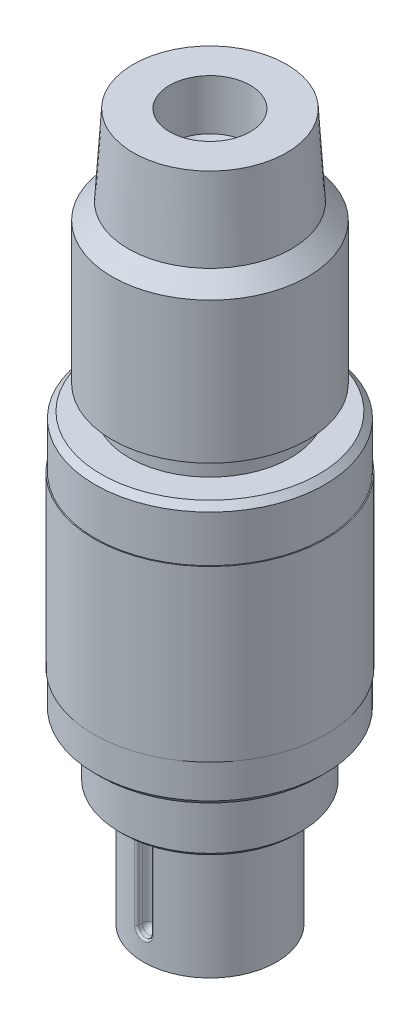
ISO-10303-21;
HEADER;
FILE_DESCRIPTION(('STEP AP214'),'2;1');
FILE_NAME('part.step','',(''),(''),'','','');
FILE_SCHEMA(('AUTOMOTIVE_DESIGN { 1 0 10303 214 1 1 1 1 }'));
ENDSEC;
DATA;
#1=APPLICATION_CONTEXT('core data for automotive mechanical design processes');
#2=APPLICATION_PROTOCOL_DEFINITION('international standard','automotive_design',2000,#1);
#3=PRODUCT_CONTEXT('',#1,'mechanical');
#4=PRODUCT('Part','Part','',(#3));
#5=PRODUCT_RELATED_PRODUCT_CATEGORY('part','',(#4));
#6=PRODUCT_DEFINITION_FORMATION('','',#4);
#7=PRODUCT_DEFINITION_CONTEXT('part definition',#1,'design');
#8=PRODUCT_DEFINITION('design','',#6,#7);
#9=PRODUCT_DEFINITION_SHAPE('','',#8);
#10=(LENGTH_UNIT() NAMED_UNIT(*) SI_UNIT(.MILLI.,.METRE.));
#11=(NAMED_UNIT(*) PLANE_ANGLE_UNIT() SI_UNIT($,.RADIAN.));
#12=(NAMED_UNIT(*) SI_UNIT($,.STERADIAN.) SOLID_ANGLE_UNIT());
#13=UNCERTAINTY_MEASURE_WITH_UNIT(LENGTH_MEASURE(1.E-05),#10,'distance_accuracy_value','');
#14=(GEOMETRIC_REPRESENTATION_CONTEXT(3) GLOBAL_UNCERTAINTY_ASSIGNED_CONTEXT((#13)) GLOBAL_UNIT_ASSIGNED_CONTEXT((#10,
#11,#12)) REPRESENTATION_CONTEXT('',''));
#15=CARTESIAN_POINT('',(0.,0.,0.));
#16=DIRECTION('',(0.,0.,1.));
#17=DIRECTION('',(1.,0.,0.));
#18=AXIS2_PLACEMENT_3D('',#15,#16,#17);
#19=CARTESIAN_POINT('',(-1.65,11.2,-1.64999999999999));
#20=DIRECTION('',(0.,1.,0.));
#21=DIRECTION('',(0.,0.,1.));
#22=AXIS2_PLACEMENT_3D('',#19,#20,#21);
#23=PLANE('',#22);
#24=CARTESIAN_POINT('',(0.,11.2,0.));
#25=DIRECTION('',(0.,1.,0.));
#26=DIRECTION('',(0.,0.,1.));
#27=AXIS2_PLACEMENT_3D('',#24,#25,#26);
#28=CIRCLE('',#27,1.5);
#29=CARTESIAN_POINT('',(0.,11.2,1.5));
#30=VERTEX_POINT('',#29);
#31=EDGE_CURVE('E543',#30,#30,#28,.F.);
#32=ORIENTED_EDGE('',*,*,#31,.F.);
#33=EDGE_LOOP('',(#32));
#34=FACE_BOUND('',#33,.T.);
#35=ADVANCED_FACE('F16',(#34),#23,.T.);
#36=CARTESIAN_POINT('',(0.,11.2,0.));
#37=DIRECTION('',(0.,1.,0.));
#38=DIRECTION('',(0.,0.,1.));
#39=AXIS2_PLACEMENT_3D('',#36,#37,#38);
#40=CYLINDRICAL_SURFACE('',#39,1.5);
#41=CARTESIAN_POINT('',(0.,23.2,0.));
#42=DIRECTION('',(0.,1.,0.));
#43=DIRECTION('',(0.,0.,1.));
#44=AXIS2_PLACEMENT_3D('',#41,#42,#43);
#45=CIRCLE('',#44,1.5);
#46=CARTESIAN_POINT('',(0.,23.2,1.5));
#47=VERTEX_POINT('',#46);
#48=EDGE_CURVE('E538',#47,#47,#45,.F.);
#49=ORIENTED_EDGE('',*,*,#48,.F.);
#50=EDGE_LOOP('',(#49));
#51=FACE_BOUND('',#50,.T.);
#52=ORIENTED_EDGE('',*,*,#31,.T.);
#53=EDGE_LOOP('',(#52));
#54=FACE_BOUND('',#53,.T.);
#55=ADVANCED_FACE('F687',(#51,#54),#40,.F.);
#56=CARTESIAN_POINT('',(0.,23.2,0.));
#57=DIRECTION('',(0.,1.,0.));
#58=DIRECTION('',(0.,0.,1.));
#59=AXIS2_PLACEMENT_3D('',#56,#57,#58);
#60=CONICAL_SURFACE('',#59,1.5,0.785398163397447);
#61=CARTESIAN_POINT('',(0.,23.7,0.));
#62=DIRECTION('',(0.,1.,0.));
#63=DIRECTION('',(0.,0.,1.));
#64=AXIS2_PLACEMENT_3D('',#61,#62,#63);
#65=CIRCLE('',#64,2.);
#66=CARTESIAN_POINT('',(0.,23.7,2.));
#67=VERTEX_POINT('',#66);
#68=EDGE_CURVE('E534',#67,#67,#65,.F.);
#69=ORIENTED_EDGE('',*,*,#68,.F.);
#70=EDGE_LOOP('',(#69));
#71=FACE_BOUND('',#70,.T.);
#72=ORIENTED_EDGE('',*,*,#48,.T.);
#73=EDGE_LOOP('',(#72));
#74=FACE_BOUND('',#73,.T.);
#75=ADVANCED_FACE('F683',(#71,#74),#60,.F.);
#76=CARTESIAN_POINT('',(0.,23.7,0.));
#77=DIRECTION('',(0.,1.,0.));
#78=DIRECTION('',(0.,0.,1.));
#79=AXIS2_PLACEMENT_3D('',#76,#77,#78);
#80=CYLINDRICAL_SURFACE('',#79,2.);
#81=CARTESIAN_POINT('',(0.,26.2,0.));
#82=DIRECTION('',(0.,1.,0.));
#83=DIRECTION('',(0.,0.,1.));
#84=AXIS2_PLACEMENT_3D('',#81,#82,#83);
#85=CIRCLE('',#84,2.);
#86=CARTESIAN_POINT('',(0.,26.2,2.));
#87=VERTEX_POINT('',#86);
#88=EDGE_CURVE('E537',#87,#87,#85,.F.);
#89=ORIENTED_EDGE('',*,*,#88,.F.);
#90=EDGE_LOOP('',(#89));
#91=FACE_BOUND('',#90,.T.);
#92=ORIENTED_EDGE('',*,*,#68,.T.);
#93=EDGE_LOOP('',(#92));
#94=FACE_BOUND('',#93,.T.);
#95=ADVANCED_FACE('F679',(#91,#94),#80,.F.);
#96=CARTESIAN_POINT('',(-4.18,26.2,-4.18));
#97=DIRECTION('',(0.,1.,0.));
#98=DIRECTION('',(0.,0.,1.));
#99=AXIS2_PLACEMENT_3D('',#96,#97,#98);
#100=PLANE('',#99);
#101=ORIENTED_EDGE('',*,*,#88,.T.);
#102=EDGE_LOOP('',(#101));
#103=FACE_BOUND('',#102,.T.);
#104=CARTESIAN_POINT('',(0.,26.2,0.));
#105=DIRECTION('',(0.,-1.,0.));
#106=DIRECTION('',(0.,0.,-1.));
#107=AXIS2_PLACEMENT_3D('',#104,#105,#106);
#108=CIRCLE('',#107,3.79999999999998);
#109=CARTESIAN_POINT('',(0.,26.2,-3.79999999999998));
#110=VERTEX_POINT('',#109);
#111=EDGE_CURVE('E531',#110,#110,#108,.T.);
#112=ORIENTED_EDGE('',*,*,#111,.F.);
#113=EDGE_LOOP('',(#112));
#114=FACE_BOUND('',#113,.T.);
#115=ADVANCED_FACE('F675',(#103,#114),#100,.T.);
#116=CARTESIAN_POINT('',(0.,22.2,0.));
#117=DIRECTION('',(0.,-1.,0.));
#118=DIRECTION('',(0.,0.,-1.));
#119=AXIS2_PLACEMENT_3D('',#116,#117,#118);
#120=CONICAL_SURFACE('',#119,4.04999999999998,0.0624188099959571);
#121=CARTESIAN_POINT('',(0.,22.2,0.));
#122=DIRECTION('',(0.,-1.,0.));
#123=DIRECTION('',(0.,0.,1.));
#124=AXIS2_PLACEMENT_3D('',#121,#122,#123);
#125=CIRCLE('',#124,4.05);
#126=CARTESIAN_POINT('',(0.,22.2,4.05));
#127=VERTEX_POINT('',#126);
#128=EDGE_CURVE('E526',#127,#127,#125,.T.);
#129=ORIENTED_EDGE('',*,*,#128,.F.);
#130=EDGE_LOOP('',(#129));
#131=FACE_BOUND('',#130,.T.);
#132=ORIENTED_EDGE('',*,*,#111,.T.);
#133=EDGE_LOOP('',(#132));
#134=FACE_BOUND('',#133,.T.);
#135=ADVANCED_FACE('F671',(#131,#134),#120,.T.);
#136=CARTESIAN_POINT('',(0.,21.4,0.));
#137=DIRECTION('',(0.,-1.,0.));
#138=DIRECTION('',(0.,0.,-1.));
#139=AXIS2_PLACEMENT_3D('',#136,#137,#138);
#140=CONICAL_SURFACE('',#139,4.85,0.785398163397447);
#141=CARTESIAN_POINT('',(0.,21.4,0.));
#142=DIRECTION('',(0.,1.,0.));
#143=DIRECTION('',(0.,0.,1.));
#144=AXIS2_PLACEMENT_3D('',#141,#142,#143);
#145=CIRCLE('',#144,4.85);
#146=CARTESIAN_POINT('',(0.,21.4,4.85000000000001));
#147=VERTEX_POINT('',#146);
#148=EDGE_CURVE('E522',#147,#147,#145,.F.);
#149=ORIENTED_EDGE('',*,*,#148,.F.);
#150=EDGE_LOOP('',(#149));
#151=FACE_BOUND('',#150,.T.);
#152=ORIENTED_EDGE('',*,*,#128,.T.);
#153=EDGE_LOOP('',(#152));
#154=FACE_BOUND('',#153,.T.);
#155=ADVANCED_FACE('F667',(#151,#154),#140,.T.);
#156=CARTESIAN_POINT('',(0.,21.4,0.));
#157=DIRECTION('',(0.,1.,0.));
#158=DIRECTION('',(0.,0.,1.));
#159=AXIS2_PLACEMENT_3D('',#156,#157,#158);
#160=CYLINDRICAL_SURFACE('',#159,4.85);
#161=CARTESIAN_POINT('',(0.,14.4,0.));
#162=DIRECTION('',(0.,1.,0.));
#163=DIRECTION('',(0.,0.,1.));
#164=AXIS2_PLACEMENT_3D('',#161,#162,#163);
#165=CIRCLE('',#164,4.85);
#166=CARTESIAN_POINT('',(0.,14.4,4.85000000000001));
#167=VERTEX_POINT('',#166);
#168=EDGE_CURVE('E525',#167,#167,#165,.F.);
#169=ORIENTED_EDGE('',*,*,#168,.F.);
#170=EDGE_LOOP('',(#169));
#171=FACE_BOUND('',#170,.T.);
#172=ORIENTED_EDGE('',*,*,#148,.T.);
#173=EDGE_LOOP('',(#172));
#174=FACE_BOUND('',#173,.T.);
#175=ADVANCED_FACE('F663',(#171,#174),#160,.T.);
#176=CARTESIAN_POINT('',(-5.335,14.4,5.33500000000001));
#177=DIRECTION('',(0.,-1.,0.));
#178=DIRECTION('',(0.,0.,-1.));
#179=AXIS2_PLACEMENT_3D('',#176,#177,#178);
#180=PLANE('',#179);
#181=CARTESIAN_POINT('',(0.,14.4,0.));
#182=DIRECTION('',(0.,1.,0.));
#183=DIRECTION('',(0.,0.,1.));
#184=AXIS2_PLACEMENT_3D('',#181,#182,#183);
#185=CIRCLE('',#184,4.00000000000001);
#186=CARTESIAN_POINT('',(0.,14.4,4.00000000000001));
#187=VERTEX_POINT('',#186);
#188=EDGE_CURVE('E1082',#187,#187,#185,.F.);
#189=ORIENTED_EDGE('',*,*,#188,.F.);
#190=EDGE_LOOP('',(#189));
#191=FACE_BOUND('',#190,.T.);
#192=ORIENTED_EDGE('',*,*,#168,.T.);
#193=EDGE_LOOP('',(#192));
#194=FACE_BOUND('',#193,.T.);
#195=ADVANCED_FACE('F659',(#191,#194),#180,.T.);
#196=CARTESIAN_POINT('',(0.,14.4,0.));
#197=DIRECTION('',(0.,1.,0.));
#198=DIRECTION('',(0.,0.,1.));
#199=AXIS2_PLACEMENT_3D('',#196,#197,#198);
#200=CYLINDRICAL_SURFACE('',#199,4.00000000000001);
#201=CARTESIAN_POINT('',(0.,13.2,0.));
#202=DIRECTION('',(0.,1.,0.));
#203=DIRECTION('',(0.,0.,1.));
#204=AXIS2_PLACEMENT_3D('',#201,#202,#203);
#205=CIRCLE('',#204,4.00000000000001);
#206=CARTESIAN_POINT('',(0.,13.2,4.00000000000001));
#207=VERTEX_POINT('',#206);
#208=EDGE_CURVE('E1085',#207,#207,#205,.F.);
#209=ORIENTED_EDGE('',*,*,#208,.F.);
#210=EDGE_LOOP('',(#209));
#211=FACE_BOUND('',#210,.T.);
#212=ORIENTED_EDGE('',*,*,#188,.T.);
#213=EDGE_LOOP('',(#212));
#214=FACE_BOUND('',#213,.T.);
#215=ADVANCED_FACE('F655',(#211,#214),#200,.T.);
#216=CARTESIAN_POINT('',(-5.93999999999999,13.2,-5.93999999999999));
#217=DIRECTION('',(0.,1.,0.));
#218=DIRECTION('',(0.,0.,1.));
#219=AXIS2_PLACEMENT_3D('',#216,#217,#218);
#220=PLANE('',#219);
#221=ORIENTED_EDGE('',*,*,#208,.T.);
#222=EDGE_LOOP('',(#221));
#223=FACE_BOUND('',#222,.T.);
#224=CARTESIAN_POINT('',(0.,13.2,0.));
#225=DIRECTION('',(0.,-1.,0.));
#226=DIRECTION('',(0.,0.,-1.));
#227=AXIS2_PLACEMENT_3D('',#224,#225,#226);
#228=CIRCLE('',#227,5.4);
#229=CARTESIAN_POINT('',(0.,13.2,-5.4));
#230=VERTEX_POINT('',#229);
#231=EDGE_CURVE('E519',#230,#230,#228,.T.);
#232=ORIENTED_EDGE('',*,*,#231,.F.);
#233=EDGE_LOOP('',(#232));
#234=FACE_BOUND('',#233,.T.);
#235=ADVANCED_FACE('F651',(#223,#234),#220,.T.);
#236=CARTESIAN_POINT('',(0.,12.9,0.));
#237=DIRECTION('',(0.,-1.,0.));
#238=DIRECTION('',(0.,0.,-1.));
#239=AXIS2_PLACEMENT_3D('',#236,#237,#238);
#240=CONICAL_SURFACE('',#239,5.7,0.785398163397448);
#241=CARTESIAN_POINT('',(0.,12.9,0.));
#242=DIRECTION('',(0.,1.,0.));
#243=DIRECTION('',(0.,0.,1.));
#244=AXIS2_PLACEMENT_3D('',#241,#242,#243);
#245=CIRCLE('',#244,5.70000000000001);
#246=CARTESIAN_POINT('',(0.,12.9,5.70000000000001));
#247=VERTEX_POINT('',#246);
#248=EDGE_CURVE('E515',#247,#247,#245,.F.);
#249=ORIENTED_EDGE('',*,*,#248,.F.);
#250=EDGE_LOOP('',(#249));
#251=FACE_BOUND('',#250,.T.);
#252=ORIENTED_EDGE('',*,*,#231,.T.);
#253=EDGE_LOOP('',(#252));
#254=FACE_BOUND('',#253,.T.);
#255=ADVANCED_FACE('F647',(#251,#254),#240,.T.);
#256=CARTESIAN_POINT('',(0.,12.9,0.));
#257=DIRECTION('',(0.,1.,0.));
#258=DIRECTION('',(0.,0.,1.));
#259=AXIS2_PLACEMENT_3D('',#256,#257,#258);
#260=CYLINDRICAL_SURFACE('',#259,5.70000000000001);
#261=CARTESIAN_POINT('',(0.,10.6,0.));
#262=DIRECTION('',(0.,1.,0.));
#263=DIRECTION('',(0.,0.,1.));
#264=AXIS2_PLACEMENT_3D('',#261,#262,#263);
#265=CIRCLE('',#264,5.70000000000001);
#266=CARTESIAN_POINT('',(0.,10.6,5.70000000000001));
#267=VERTEX_POINT('',#266);
#268=EDGE_CURVE('E518',#267,#267,#265,.F.);
#269=ORIENTED_EDGE('',*,*,#268,.F.);
#270=EDGE_LOOP('',(#269));
#271=FACE_BOUND('',#270,.T.);
#272=ORIENTED_EDGE('',*,*,#248,.T.);
#273=EDGE_LOOP('',(#272));
#274=FACE_BOUND('',#273,.T.);
#275=ADVANCED_FACE('F643',(#271,#274),#260,.T.);
#276=CARTESIAN_POINT('',(-6.32499999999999,10.6,-6.325));
#277=DIRECTION('',(0.,1.,0.));
#278=DIRECTION('',(0.,0.,1.));
#279=AXIS2_PLACEMENT_3D('',#276,#277,#278);
#280=PLANE('',#279);
#281=ORIENTED_EDGE('',*,*,#268,.T.);
#282=EDGE_LOOP('',(#281));
#283=FACE_BOUND('',#282,.T.);
#284=CARTESIAN_POINT('',(0.,10.6,0.));
#285=DIRECTION('',(0.,1.,0.));
#286=DIRECTION('',(0.,0.,1.));
#287=AXIS2_PLACEMENT_3D('',#284,#285,#286);
#288=CIRCLE('',#287,5.75);
#289=CARTESIAN_POINT('',(0.,10.6,5.75));
#290=VERTEX_POINT('',#289);
#291=EDGE_CURVE('E1092',#290,#290,#288,.F.);
#292=ORIENTED_EDGE('',*,*,#291,.F.);
#293=EDGE_LOOP('',(#292));
#294=FACE_BOUND('',#293,.T.);
#295=ADVANCED_FACE('F639',(#283,#294),#280,.T.);
#296=CARTESIAN_POINT('',(0.,10.6,0.));
#297=DIRECTION('',(0.,1.,0.));
#298=DIRECTION('',(0.,0.,1.));
#299=AXIS2_PLACEMENT_3D('',#296,#297,#298);
#300=CYLINDRICAL_SURFACE('',#299,5.75);
#301=CARTESIAN_POINT('',(0.,2.19999999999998,0.));
#302=DIRECTION('',(0.,1.,0.));
#303=DIRECTION('',(0.,0.,1.));
#304=AXIS2_PLACEMENT_3D('',#301,#302,#303);
#305=CIRCLE('',#304,5.75);
#306=CARTESIAN_POINT('',(0.,2.19999999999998,5.75));
#307=VERTEX_POINT('',#306);
#308=EDGE_CURVE('E508',#307,#307,#305,.F.);
#309=ORIENTED_EDGE('',*,*,#308,.F.);
#310=EDGE_LOOP('',(#309));
#311=FACE_BOUND('',#310,.T.);
#312=ORIENTED_EDGE('',*,*,#291,.T.);
#313=EDGE_LOOP('',(#312));
#314=FACE_BOUND('',#313,.T.);
#315=ADVANCED_FACE('F635',(#311,#314),#300,.T.);
#316=CARTESIAN_POINT('',(-6.32499999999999,2.19999999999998,6.325));
#317=DIRECTION('',(0.,-1.,0.));
#318=DIRECTION('',(0.,0.,-1.));
#319=AXIS2_PLACEMENT_3D('',#316,#317,#318);
#320=PLANE('',#319);
#321=CARTESIAN_POINT('',(0.,2.19999999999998,0.));
#322=DIRECTION('',(0.,1.,0.));
#323=DIRECTION('',(0.,0.,1.));
#324=AXIS2_PLACEMENT_3D('',#321,#322,#323);
#325=CIRCLE('',#324,5.7);
#326=CARTESIAN_POINT('',(0.,2.19999999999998,5.7));
#327=VERTEX_POINT('',#326);
#328=EDGE_CURVE('E501',#327,#327,#325,.F.);
#329=ORIENTED_EDGE('',*,*,#328,.F.);
#330=EDGE_LOOP('',(#329));
#331=FACE_BOUND('',#330,.T.);
#332=ORIENTED_EDGE('',*,*,#308,.T.);
#333=EDGE_LOOP('',(#332));
#334=FACE_BOUND('',#333,.T.);
#335=ADVANCED_FACE('F631',(#331,#334),#320,.T.);
#336=CARTESIAN_POINT('',(0.,2.19999999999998,0.));
#337=DIRECTION('',(0.,1.,0.));
#338=DIRECTION('',(0.,0.,1.));
#339=AXIS2_PLACEMENT_3D('',#336,#337,#338);
#340=CYLINDRICAL_SURFACE('',#339,5.7);
#341=CARTESIAN_POINT('',(0.,0.5,0.));
#342=DIRECTION('',(0.,1.,0.));
#343=DIRECTION('',(0.,0.,1.));
#344=AXIS2_PLACEMENT_3D('',#341,#342,#343);
#345=CIRCLE('',#344,5.7);
#346=CARTESIAN_POINT('',(0.,0.500000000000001,5.7));
#347=VERTEX_POINT('',#346);
#348=EDGE_CURVE('E497',#347,#347,#345,.F.);
#349=ORIENTED_EDGE('',*,*,#348,.F.);
#350=EDGE_LOOP('',(#349));
#351=FACE_BOUND('',#350,.T.);
#352=ORIENTED_EDGE('',*,*,#328,.T.);
#353=EDGE_LOOP('',(#352));
#354=FACE_BOUND('',#353,.T.);
#355=ADVANCED_FACE('F628',(#351,#354),#340,.T.);
#356=CARTESIAN_POINT('',(0.,0.5,0.));
#357=DIRECTION('',(0.,1.,0.));
#358=DIRECTION('',(0.,0.,1.));
#359=AXIS2_PLACEMENT_3D('',#356,#357,#358);
#360=CONICAL_SURFACE('',#359,5.7,0.785398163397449);
#361=CARTESIAN_POINT('',(0.,0.199999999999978,0.));
#362=DIRECTION('',(0.,1.,0.));
#363=DIRECTION('',(0.,0.,1.));
#364=AXIS2_PLACEMENT_3D('',#361,#362,#363);
#365=CIRCLE('',#364,5.4);
#366=CARTESIAN_POINT('',(0.,0.199999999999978,5.4));
#367=VERTEX_POINT('',#366);
#368=EDGE_CURVE('E455',#367,#367,#365,.F.);
#369=ORIENTED_EDGE('',*,*,#368,.F.);
#370=EDGE_LOOP('',(#369));
#371=FACE_BOUND('',#370,.T.);
#372=ORIENTED_EDGE('',*,*,#348,.T.);
#373=EDGE_LOOP('',(#372));
#374=FACE_BOUND('',#373,.T.);
#375=ADVANCED_FACE('F625',(#371,#374),#360,.T.);
#376=CARTESIAN_POINT('',(0.,-1.35000000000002,3.));
#377=DIRECTION('',(0.,0.,1.));
#378=DIRECTION('',(-1.,0.,0.));
#379=AXIS2_PLACEMENT_3D('',#376,#377,#378);
#380=SPHERICAL_SURFACE('',#379,0.35);
#381=CARTESIAN_POINT('',(0.,-1.35000000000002,3.00000000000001));
#382=DIRECTION('',(0.,1.,0.));
#383=DIRECTION('',(0.,0.,1.));
#384=AXIS2_PLACEMENT_3D('',#381,#382,#383);
#385=CIRCLE('',#384,0.35);
#386=CARTESIAN_POINT('',(0.350000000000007,-1.35000000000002,3.));
#387=VERTEX_POINT('',#386);
#388=CARTESIAN_POINT('',(-0.349999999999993,-1.35000000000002,3.));
#389=VERTEX_POINT('',#388);
#390=EDGE_CURVE('E115',#387,#389,#385,.T.);
#391=ORIENTED_EDGE('',*,*,#390,.F.);
#392=CARTESIAN_POINT('',(0.,-1.35000000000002,3.));
#393=DIRECTION('',(0.,0.,1.));
#394=DIRECTION('',(0.707106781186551,0.707106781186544,0.));
#395=AXIS2_PLACEMENT_3D('',#392,#393,#394);
#396=CIRCLE('',#395,0.349999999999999);
#397=EDGE_CURVE('E454',#389,#387,#396,.F.);
#398=ORIENTED_EDGE('',*,*,#397,.F.);
#399=EDGE_LOOP('',(#391,#398));
#400=FACE_BOUND('',#399,.T.);
#401=ADVANCED_FACE('F491',(#400),#380,.F.);
#402=CARTESIAN_POINT('',(-5.93999999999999,0.199999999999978,5.94));
#403=DIRECTION('',(0.,-1.,0.));
#404=DIRECTION('',(0.,0.,-1.));
#405=AXIS2_PLACEMENT_3D('',#402,#403,#404);
#406=PLANE('',#405);
#407=CARTESIAN_POINT('',(0.,0.199999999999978,0.));
#408=DIRECTION('',(0.,1.,0.));
#409=DIRECTION('',(-1.,0.,0.));
#410=AXIS2_PLACEMENT_3D('',#407,#408,#409);
#411=CIRCLE('',#410,4.5);
#412=CARTESIAN_POINT('',(-4.5,0.199999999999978,0.));
#413=VERTEX_POINT('',#412);
#414=EDGE_CURVE('E438',#413,#413,#411,.F.);
#415=ORIENTED_EDGE('',*,*,#414,.F.);
#416=EDGE_LOOP('',(#415));
#417=FACE_BOUND('',#416,.T.);
#418=ORIENTED_EDGE('',*,*,#368,.T.);
#419=EDGE_LOOP('',(#418));
#420=FACE_BOUND('',#419,.T.);
#421=ADVANCED_FACE('F488',(#417,#420),#406,.T.);
#422=CARTESIAN_POINT('',(0.,-7.45000000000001,3.));
#423=DIRECTION('',(0.,0.,1.));
#424=DIRECTION('',(-1.,0.,0.));
#425=AXIS2_PLACEMENT_3D('',#422,#423,#424);
#426=SPHERICAL_SURFACE('',#425,0.35);
#427=CARTESIAN_POINT('',(0.,-7.45000000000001,3.));
#428=DIRECTION('',(0.,1.,0.));
#429=DIRECTION('',(0.,0.,1.));
#430=AXIS2_PLACEMENT_3D('',#427,#428,#429);
#431=CIRCLE('',#430,0.35);
#432=CARTESIAN_POINT('',(-0.349999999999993,-7.45000000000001,3.));
#433=VERTEX_POINT('',#432);
#434=CARTESIAN_POINT('',(0.350000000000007,-7.45000000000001,3.));
#435=VERTEX_POINT('',#434);
#436=EDGE_CURVE('E20',#433,#435,#431,.F.);
#437=ORIENTED_EDGE('',*,*,#436,.F.);
#438=CARTESIAN_POINT('',(0.,-7.45000000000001,3.));
#439=DIRECTION('',(0.,0.,1.));
#440=DIRECTION('',(-0.707106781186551,-0.707106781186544,0.));
#441=AXIS2_PLACEMENT_3D('',#438,#439,#440);
#442=CIRCLE('',#441,0.349999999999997);
#443=EDGE_CURVE('E184',#435,#433,#442,.F.);
#444=ORIENTED_EDGE('',*,*,#443,.F.);
#445=EDGE_LOOP('',(#437,#444));
#446=FACE_BOUND('',#445,.T.);
#447=ADVANCED_FACE('F18',(#446),#426,.F.);
#448=CARTESIAN_POINT('',(0.,-7.45000000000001,3.));
#449=DIRECTION('',(0.,1.,0.));
#450=DIRECTION('',(0.,0.,1.));
#451=AXIS2_PLACEMENT_3D('',#448,#449,#450);
#452=CYLINDRICAL_SURFACE('',#451,0.35);
#453=ORIENTED_EDGE('',*,*,#436,.T.);
#454=DIRECTION('',(0.,1.,0.));
#455=VECTOR('',#454,1.);
#456=CARTESIAN_POINT('',(0.350000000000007,-7.75500000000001,3.));
#457=LINE('',#456,#455);
#458=EDGE_CURVE('E178',#387,#435,#457,.F.);
#459=ORIENTED_EDGE('',*,*,#458,.F.);
#460=ORIENTED_EDGE('',*,*,#390,.T.);
#461=DIRECTION('',(0.,1.,0.));
#462=VECTOR('',#461,1.);
#463=CARTESIAN_POINT('',(-0.349999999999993,-7.75500000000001,3.));
#464=LINE('',#463,#462);
#465=EDGE_CURVE('E289',#433,#389,#464,.T.);
#466=ORIENTED_EDGE('',*,*,#465,.F.);
#467=EDGE_LOOP('',(#453,#459,#460,#466));
#468=FACE_BOUND('',#467,.T.);
#469=ADVANCED_FACE('F615',(#468),#452,.F.);
#470=CARTESIAN_POINT('',(0.,-1.35000000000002,3.));
#471=DIRECTION('',(0.,0.,1.));
#472=DIRECTION('',(1.,0.,0.));
#473=AXIS2_PLACEMENT_3D('',#470,#471,#472);
#474=CYLINDRICAL_SURFACE('',#473,0.349999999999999);
#475=ORIENTED_EDGE('',*,*,#397,.T.);
#476=DIRECTION('',(0.,0.,1.));
#477=VECTOR('',#476,1.);
#478=CARTESIAN_POINT('',(0.350000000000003,-1.35000000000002,2.9859306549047));
#479=LINE('',#478,#477);
#480=CARTESIAN_POINT('',(0.35,-1.35000000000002,3.28138690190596));
#481=VERTEX_POINT('',#480);
#482=EDGE_CURVE('E592',#481,#387,#479,.F.);
#483=ORIENTED_EDGE('',*,*,#482,.F.);
#484=CARTESIAN_POINT('',(-0.349999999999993,-1.35000000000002,3.28138690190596));
#485=CARTESIAN_POINT('',(-0.350016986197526,-1.33036857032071,3.28138007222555));
#486=CARTESIAN_POINT('',(-0.348349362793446,-1.31074338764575,3.28156288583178));
#487=CARTESIAN_POINT('',(-0.341771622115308,-1.2720685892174,3.28225711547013));
#488=CARTESIAN_POINT('',(-0.336864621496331,-1.2530184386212,3.28276821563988));
#489=CARTESIAN_POINT('',(-0.32393192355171,-1.2160098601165,3.28406876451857));
#490=CARTESIAN_POINT('',(-0.315905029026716,-1.19805185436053,3.28485832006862));
#491=CARTESIAN_POINT('',(-0.296969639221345,-1.16374016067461,3.28662436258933));
#492=CARTESIAN_POINT('',(-0.286061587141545,-1.14738622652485,3.28760082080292));
#493=CARTESIAN_POINT('',(-0.261626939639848,-1.11668111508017,3.2896354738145));
#494=CARTESIAN_POINT('',(-0.248091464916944,-1.10233702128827,3.29069393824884));
#495=CARTESIAN_POINT('',(-0.218799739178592,-1.0761147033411,3.29277115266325));
#496=CARTESIAN_POINT('',(-0.203042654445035,-1.06423740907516,3.29378988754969));
#497=CARTESIAN_POINT('',(-0.169707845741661,-1.04326190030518,3.29567572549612));
#498=CARTESIAN_POINT('',(-0.152125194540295,-1.03417148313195,3.29654240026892));
#499=CARTESIAN_POINT('',(-0.115685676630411,-1.01908487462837,3.2980218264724));
#500=CARTESIAN_POINT('',(-0.0968303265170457,-1.01308507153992,3.29863487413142));
#501=CARTESIAN_POINT('',(-0.0648934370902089,-1.00582066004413,3.29938655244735));
#502=CARTESIAN_POINT('',(-0.0520147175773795,-1.00364097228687,3.29961550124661));
#503=CARTESIAN_POINT('',(-0.0260925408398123,-1.00073035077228,3.29992230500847));
#504=CARTESIAN_POINT('',(-0.0130490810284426,-0.999999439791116,3.30000015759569));
#505=CARTESIAN_POINT('',(0.0196009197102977,-1.00000084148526,3.29999976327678));
#506=CARTESIAN_POINT('',(0.0392145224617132,-1.00165208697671,3.29982351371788));
#507=CARTESIAN_POINT('',(0.0778970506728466,-1.00821395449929,3.29913738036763));
#508=CARTESIAN_POINT('',(0.0969653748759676,-1.01312803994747,3.29862714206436));
#509=CARTESIAN_POINT('',(0.133992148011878,-1.0260704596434,3.29733060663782));
#510=CARTESIAN_POINT('',(0.151951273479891,-1.03409687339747,3.29654447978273));
#511=CARTESIAN_POINT('',(0.186264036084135,-1.05303250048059,3.29478394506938));
#512=CARTESIAN_POINT('',(0.202617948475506,-1.06394121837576,3.29380956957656));
#513=CARTESIAN_POINT('',(0.233324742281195,-1.08837824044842,3.29177726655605));
#514=CARTESIAN_POINT('',(0.247670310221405,-1.10191571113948,3.29071905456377));
#515=CARTESIAN_POINT('',(0.273890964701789,-1.13120760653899,3.28864062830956));
#516=CARTESIAN_POINT('',(0.285765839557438,-1.14696222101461,3.28762041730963));
#517=CARTESIAN_POINT('',(0.30673601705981,-1.18028913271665,3.28573044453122));
#518=CARTESIAN_POINT('',(0.315823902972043,-1.19786611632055,3.2848610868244));
#519=CARTESIAN_POINT('',(0.33091228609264,-1.23430501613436,3.28337553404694));
#520=CARTESIAN_POINT('',(0.336914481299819,-1.2531662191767,3.28275919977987));
#521=CARTESIAN_POINT('',(0.344181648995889,-1.28511770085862,3.28200357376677));
#522=CARTESIAN_POINT('',(0.346361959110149,-1.29800509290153,3.28177346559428));
#523=CARTESIAN_POINT('',(0.34927107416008,-1.32392645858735,3.28146466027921));
#524=CARTESIAN_POINT('',(0.350001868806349,-1.33696020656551,3.28138575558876));
#525=CARTESIAN_POINT('',(0.35,-1.35000000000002,3.28138690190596));
#526=B_SPLINE_CURVE_WITH_KNOTS('',3,(#484,#485,#486,#487,#488,#489,#490,#491,#492,#493,#494,
#495,#496,#497,#498,#499,#500,#501,#502,#503,#504,#505,#506,#507,#508,#509,#510,#511,#512,#513,
#514,#515,#516,#517,#518,#519,#520,#521,#522,#523,#524,#525),.UNSPECIFIED.,.F.,.F.,(4,2,2,2,2,2,
2,2,2,2,2,2,2,2,2,2,2,2,2,2,4),(0.,0.0588135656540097,0.117570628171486,0.176350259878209,
0.235120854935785,0.294093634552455,0.353088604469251,0.412247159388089,0.471336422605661,
0.510451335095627,0.549566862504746,0.608321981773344,0.667139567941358,0.725920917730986,
0.784692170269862,0.843672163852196,0.90265720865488,0.961797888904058,1.02090599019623,
1.06004674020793,1.09913372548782),.UNSPECIFIED.);
#527=CARTESIAN_POINT('',(-0.349999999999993,-1.35000000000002,3.28138690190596));
#528=VERTEX_POINT('',#527);
#529=EDGE_CURVE('E446',#528,#481,#526,.T.);
#530=ORIENTED_EDGE('',*,*,#529,.F.);
#531=DIRECTION('',(0.,0.,-1.));
#532=VECTOR('',#531,1.);
#533=CARTESIAN_POINT('',(-0.349999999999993,-1.35000000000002,3.29545624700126));
#534=LINE('',#533,#532);
#535=EDGE_CURVE('E598',#389,#528,#534,.F.);
#536=ORIENTED_EDGE('',*,*,#535,.F.);
#537=EDGE_LOOP('',(#475,#483,#530,#536));
#538=FACE_BOUND('',#537,.T.);
#539=ADVANCED_FACE('F457',(#538),#474,.F.);
#540=CARTESIAN_POINT('',(0.,-2.80000000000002,0.));
#541=DIRECTION('',(0.,1.,0.));
#542=DIRECTION('',(-1.,0.,0.));
#543=AXIS2_PLACEMENT_3D('',#540,#541,#542);
#544=CYLINDRICAL_SURFACE('',#543,3.3);
#545=CARTESIAN_POINT('',(0.,-2.80000000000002,0.));
#546=DIRECTION('',(0.,1.,0.));
#547=DIRECTION('',(-1.,0.,0.));
#548=AXIS2_PLACEMENT_3D('',#545,#546,#547);
#549=CIRCLE('',#548,3.3);
#550=CARTESIAN_POINT('',(0.350000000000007,-2.80000000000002,3.28138690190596));
#551=VERTEX_POINT('',#550);
#552=CARTESIAN_POINT('',(-0.349999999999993,-2.80000000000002,3.28138690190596));
#553=VERTEX_POINT('',#552);
#554=EDGE_CURVE('E443',#551,#553,#549,.F.);
#555=ORIENTED_EDGE('',*,*,#554,.T.);
#556=DIRECTION('',(0.,1.,0.));
#557=VECTOR('',#556,1.);
#558=CARTESIAN_POINT('',(-0.349999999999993,-7.75500000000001,3.28138690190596));
#559=LINE('',#558,#557);
#560=EDGE_CURVE('E293',#528,#553,#559,.F.);
#561=ORIENTED_EDGE('',*,*,#560,.F.);
#562=ORIENTED_EDGE('',*,*,#529,.T.);
#563=DIRECTION('',(0.,1.,0.));
#564=VECTOR('',#563,1.);
#565=CARTESIAN_POINT('',(0.350000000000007,-7.75500000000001,3.28138690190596));
#566=LINE('',#565,#564);
#567=EDGE_CURVE('E511',#551,#481,#566,.T.);
#568=ORIENTED_EDGE('',*,*,#567,.F.);
#569=EDGE_LOOP('',(#555,#561,#562,#568));
#570=FACE_BOUND('',#569,.T.);
#571=ADVANCED_FACE('F460',(#570),#544,.F.);
#572=CARTESIAN_POINT('',(0.,0.199999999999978,0.));
#573=DIRECTION('',(0.,1.,0.));
#574=DIRECTION('',(-1.,0.,0.));
#575=AXIS2_PLACEMENT_3D('',#572,#573,#574);
#576=CYLINDRICAL_SURFACE('',#575,4.5);
#577=CARTESIAN_POINT('',(0.,-2.59999999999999,0.));
#578=DIRECTION('',(0.,1.,0.));
#579=DIRECTION('',(0.,0.,1.));
#580=AXIS2_PLACEMENT_3D('',#577,#578,#579);
#581=CIRCLE('',#580,4.5);
#582=CARTESIAN_POINT('',(0.,-2.59999999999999,4.5));
#583=VERTEX_POINT('',#582);
#584=EDGE_CURVE('E195',#583,#583,#581,.F.);
#585=ORIENTED_EDGE('',*,*,#584,.F.);
#586=EDGE_LOOP('',(#585));
#587=FACE_BOUND('',#586,.T.);
#588=ORIENTED_EDGE('',*,*,#414,.T.);
#589=EDGE_LOOP('',(#588));
#590=FACE_BOUND('',#589,.T.);
#591=ADVANCED_FACE('F464',(#587,#590),#576,.T.);
#592=CARTESIAN_POINT('',(0.350000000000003,-7.75500000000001,2.9859306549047));
#593=DIRECTION('',(-1.,0.,0.));
#594=DIRECTION('',(0.,0.,1.));
#595=AXIS2_PLACEMENT_3D('',#592,#593,#594);
#596=PLANE('',#595);
#597=ORIENTED_EDGE('',*,*,#458,.T.);
#598=DIRECTION('',(0.,0.,-1.));
#599=VECTOR('',#598,1.);
#600=CARTESIAN_POINT('',(0.349999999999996,-7.45000000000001,3.09999998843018));
#601=LINE('',#600,#599);
#602=CARTESIAN_POINT('',(0.35,-7.45000000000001,3.16820138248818));
#603=VERTEX_POINT('',#602);
#604=EDGE_CURVE('E171',#603,#435,#601,.T.);
#605=ORIENTED_EDGE('',*,*,#604,.F.);
#606=DIRECTION('',(0.,-1.,0.));
#607=VECTOR('',#606,1.);
#608=CARTESIAN_POINT('',(0.350000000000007,-5.12499999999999,3.16820138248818));
#609=LINE('',#608,#607);
#610=CARTESIAN_POINT('',(0.35000000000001,-2.80000000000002,3.16820138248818));
#611=VERTEX_POINT('',#610);
#612=EDGE_CURVE('E175',#611,#603,#609,.T.);
#613=ORIENTED_EDGE('',*,*,#612,.F.);
#614=DIRECTION('',(0.,0.,1.));
#615=VECTOR('',#614,1.);
#616=CARTESIAN_POINT('',(0.350000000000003,-2.80000000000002,2.9859306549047));
#617=LINE('',#616,#615);
#618=EDGE_CURVE('E442',#611,#551,#617,.T.);
#619=ORIENTED_EDGE('',*,*,#618,.T.);
#620=ORIENTED_EDGE('',*,*,#567,.T.);
#621=ORIENTED_EDGE('',*,*,#482,.T.);
#622=EDGE_LOOP('',(#597,#605,#613,#619,#620,#621));
#623=FACE_BOUND('',#622,.T.);
#624=ADVANCED_FACE('F173',(#623),#596,.T.);
#625=CARTESIAN_POINT('',(0.,-7.45000000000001,3.));
#626=DIRECTION('',(0.,0.,1.));
#627=DIRECTION('',(1.,0.,0.));
#628=AXIS2_PLACEMENT_3D('',#625,#626,#627);
#629=CYLINDRICAL_SURFACE('',#628,0.349999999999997);
#630=ORIENTED_EDGE('',*,*,#443,.T.);
#631=DIRECTION('',(0.,0.,-1.));
#632=VECTOR('',#631,1.);
#633=CARTESIAN_POINT('',(-0.349999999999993,-7.45000000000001,3.29545624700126));
#634=LINE('',#633,#632);
#635=CARTESIAN_POINT('',(-0.349999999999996,-7.45000000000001,3.16820138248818));
#636=VERTEX_POINT('',#635);
#637=EDGE_CURVE('E202',#636,#433,#634,.T.);
#638=ORIENTED_EDGE('',*,*,#637,.F.);
#639=CARTESIAN_POINT('',(0.35,-7.45000000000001,3.16820138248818));
#640=CARTESIAN_POINT('',(0.35,-7.5147670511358,3.16820138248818));
#641=CARTESIAN_POINT('',(0.331665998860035,-7.57940944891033,3.17177321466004));
#642=CARTESIAN_POINT('',(0.266233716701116,-7.68467465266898,3.18189314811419));
#643=CARTESIAN_POINT('',(0.222693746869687,-7.72634029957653,3.18784945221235));
#644=CARTESIAN_POINT('',(0.139402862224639,-7.77313623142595,3.19524339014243));
#645=CARTESIAN_POINT('',(0.104852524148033,-7.78594877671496,3.19749625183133));
#646=CARTESIAN_POINT('',(0.046187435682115,-7.79770140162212,3.19958056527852));
#647=CARTESIAN_POINT('',(0.0231447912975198,-7.79998033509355,3.19999644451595));
#648=CARTESIAN_POINT('',(-0.0341422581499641,-7.8000293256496,3.20000530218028));
#649=CARTESIAN_POINT('',(-0.0688914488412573,-7.79489585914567,3.19905790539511));
#650=CARTESIAN_POINT('',(-0.155017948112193,-7.76865239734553,3.19451521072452));
#651=CARTESIAN_POINT('',(-0.20396779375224,-7.73969673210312,3.1896449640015));
#652=CARTESIAN_POINT('',(-0.310344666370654,-7.63667537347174,3.1762001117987));
#653=CARTESIAN_POINT('',(-0.349999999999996,-7.54305180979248,3.16820138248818));
#654=CARTESIAN_POINT('',(-0.349999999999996,-7.45000000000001,3.16820138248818));
#655=B_SPLINE_CURVE_WITH_KNOTS('',3,(#639,#640,#641,#642,#643,#644,#645,#646,#647,#648,#649,
#650,#651,#652,#653,#654),.UNSPECIFIED.,.F.,.F.,(4,2,2,2,2,2,2,4),(0.,0.024981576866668,
0.0475001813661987,0.0615743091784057,0.0703706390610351,0.0836318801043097,0.104849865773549,
0.14074127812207),.UNSPECIFIED.);
#656=EDGE_CURVE('E198',#603,#636,#655,.T.);
#657=ORIENTED_EDGE('',*,*,#656,.F.);
#658=ORIENTED_EDGE('',*,*,#604,.T.);
#659=EDGE_LOOP('',(#630,#638,#657,#658));
#660=FACE_BOUND('',#659,.T.);
#661=ADVANCED_FACE('F200',(#660),#629,.F.);
#662=CARTESIAN_POINT('',(-0.349999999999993,-7.75500000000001,3.29545624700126));
#663=DIRECTION('',(1.,0.,0.));
#664=DIRECTION('',(0.,0.,-1.));
#665=AXIS2_PLACEMENT_3D('',#662,#663,#664);
#666=PLANE('',#665);
#667=ORIENTED_EDGE('',*,*,#560,.T.);
#668=DIRECTION('',(0.,0.,-1.));
#669=VECTOR('',#668,1.);
#670=CARTESIAN_POINT('',(-0.349999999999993,-2.80000000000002,3.29545624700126));
#671=LINE('',#670,#669);
#672=CARTESIAN_POINT('',(-0.349999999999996,-2.80000000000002,3.16820138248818));
#673=VERTEX_POINT('',#672);
#674=EDGE_CURVE('E290',#553,#673,#671,.T.);
#675=ORIENTED_EDGE('',*,*,#674,.T.);
#676=DIRECTION('',(0.,1.,0.));
#677=VECTOR('',#676,1.);
#678=CARTESIAN_POINT('',(-0.35,-5.12499999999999,3.16820138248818));
#679=LINE('',#678,#677);
#680=EDGE_CURVE('E303',#636,#673,#679,.T.);
#681=ORIENTED_EDGE('',*,*,#680,.F.);
#682=ORIENTED_EDGE('',*,*,#637,.T.);
#683=ORIENTED_EDGE('',*,*,#465,.T.);
#684=ORIENTED_EDGE('',*,*,#535,.T.);
#685=EDGE_LOOP('',(#667,#675,#681,#682,#683,#684));
#686=FACE_BOUND('',#685,.T.);
#687=ADVANCED_FACE('F473',(#686),#666,.T.);
#688=CARTESIAN_POINT('',(0.,-2.59999999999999,0.));
#689=DIRECTION('',(0.,1.,0.));
#690=DIRECTION('',(0.,0.,1.));
#691=AXIS2_PLACEMENT_3D('',#688,#689,#690);
#692=CONICAL_SURFACE('',#691,4.5,0.785398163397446);
#693=CARTESIAN_POINT('',(0.,-2.80000000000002,0.));
#694=DIRECTION('',(0.,1.,0.));
#695=DIRECTION('',(0.,0.,1.));
#696=AXIS2_PLACEMENT_3D('',#693,#694,#695);
#697=CIRCLE('',#696,4.3);
#698=CARTESIAN_POINT('',(0.,-2.80000000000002,4.3));
#699=VERTEX_POINT('',#698);
#700=EDGE_CURVE('E306',#699,#699,#697,.F.);
#701=ORIENTED_EDGE('',*,*,#700,.F.);
#702=EDGE_LOOP('',(#701));
#703=FACE_BOUND('',#702,.T.);
#704=ORIENTED_EDGE('',*,*,#584,.T.);
#705=EDGE_LOOP('',(#704));
#706=FACE_BOUND('',#705,.T.);
#707=ADVANCED_FACE('F475',(#703,#706),#692,.T.);
#708=CARTESIAN_POINT('',(0.450000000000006,-7.45000000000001,3.16820138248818));
#709=DIRECTION('',(0.,-1.,0.));
#710=DIRECTION('',(1.,0.,0.));
#711=AXIS2_PLACEMENT_3D('',#708,#709,#710);
#712=CYLINDRICAL_SURFACE('',#711,0.0999999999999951);
#713=CARTESIAN_POINT('',(0.464062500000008,-7.45000000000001,3.26720767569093));
#714=CARTESIAN_POINT('',(0.435814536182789,-7.45000000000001,3.27121991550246));
#715=CARTESIAN_POINT('',(0.375991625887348,-7.45000000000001,3.25346444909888));
#716=CARTESIAN_POINT('',(0.350000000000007,-7.45000000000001,3.19673286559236));
#717=CARTESIAN_POINT('',(0.35,-7.45000000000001,3.16820138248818));
#718=B_SPLINE_CURVE_WITH_KNOTS('',3,(#713,#714,#715,#716,#717),.UNSPECIFIED.,.F.,.F.,(4,1,4),
(0.,0.5,1.),.UNSPECIFIED.);
#719=CARTESIAN_POINT('',(0.464062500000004,-7.45000000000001,3.26720767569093));
#720=VERTEX_POINT('',#719);
#721=EDGE_CURVE('E189',#720,#603,#718,.T.);
#722=ORIENTED_EDGE('',*,*,#721,.F.);
#723=DIRECTION('',(0.,-1.,0.));
#724=VECTOR('',#723,1.);
#725=CARTESIAN_POINT('',(0.464062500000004,-5.80000000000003,3.26720767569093));
#726=LINE('',#725,#724);
#727=CARTESIAN_POINT('',(0.464062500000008,-2.80000000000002,3.26720767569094));
#728=VERTEX_POINT('',#727);
#729=EDGE_CURVE('E416',#728,#720,#726,.T.);
#730=ORIENTED_EDGE('',*,*,#729,.F.);
#731=CARTESIAN_POINT('',(0.45000000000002,-2.80000000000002,3.16820138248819));
#732=DIRECTION('',(0.,-1.,0.));
#733=DIRECTION('',(1.,0.,0.));
#734=AXIS2_PLACEMENT_3D('',#731,#732,#733);
#735=CIRCLE('',#734,0.0999999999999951);
#736=EDGE_CURVE('E193',#611,#728,#735,.F.);
#737=ORIENTED_EDGE('',*,*,#736,.F.);
#738=ORIENTED_EDGE('',*,*,#612,.T.);
#739=EDGE_LOOP('',(#722,#730,#737,#738));
#740=FACE_BOUND('',#739,.T.);
#741=ADVANCED_FACE('F187',(#740),#712,.T.);
#742=CARTESIAN_POINT('',(-0.464062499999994,-7.45000000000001,3.26720767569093));
#743=CARTESIAN_POINT('',(-0.435814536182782,-7.45000000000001,3.27121991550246));
#744=CARTESIAN_POINT('',(-0.375991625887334,-7.45000000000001,3.25346444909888));
#745=CARTESIAN_POINT('',(-0.349999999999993,-7.45000000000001,3.19673286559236));
#746=CARTESIAN_POINT('',(-0.349999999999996,-7.45000000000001,3.16820138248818));
#747=CARTESIAN_POINT('',(-0.464062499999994,-7.56963804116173,3.26720767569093));
#748=CARTESIAN_POINT('',(-0.435814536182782,-7.56197646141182,3.27121991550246));
#749=CARTESIAN_POINT('',(-0.375991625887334,-7.54674228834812,3.25346444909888));
#750=CARTESIAN_POINT('',(-0.349999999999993,-7.54197440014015,3.19673286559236));
#751=CARTESIAN_POINT('',(-0.349999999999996,-7.54305180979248,3.16820138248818));
#752=CARTESIAN_POINT('',(-0.411483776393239,-7.69001119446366,3.27545636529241));
#753=CARTESIAN_POINT('',(-0.387060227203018,-7.67490878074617,3.27837134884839));
#754=CARTESIAN_POINT('',(-0.335398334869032,-7.64486768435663,3.2595089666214));
#755=CARTESIAN_POINT('',(-0.311429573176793,-7.63491246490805,3.20406753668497));
#756=CARTESIAN_POINT('',(-0.310344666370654,-7.63667537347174,3.1762001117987));
#757=CARTESIAN_POINT('',(-0.270439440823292,-7.8224672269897,3.28932136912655));
#758=CARTESIAN_POINT('',(-0.254861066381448,-7.80010126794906,3.29054884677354));
#759=CARTESIAN_POINT('',(-0.221967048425,-7.75557261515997,3.27004479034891));
#760=CARTESIAN_POINT('',(-0.20552566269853,-7.73860905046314,3.21652565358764));
#761=CARTESIAN_POINT('',(-0.20396779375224,-7.73969673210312,3.1896449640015));
#762=CARTESIAN_POINT('',(-0.205537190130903,-7.85969593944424,3.29434381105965));
#763=CARTESIAN_POINT('',(-0.193824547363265,-7.83547610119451,3.29498818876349));
#764=CARTESIAN_POINT('',(-0.16911158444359,-7.78724286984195,3.27392849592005));
#765=CARTESIAN_POINT('',(-0.156433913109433,-7.76804976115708,3.22106160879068));
#766=CARTESIAN_POINT('',(-0.155017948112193,-7.76865239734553,3.19451521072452));
#767=CARTESIAN_POINT('',(-0.0913426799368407,-7.89343753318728,3.29902846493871));
#768=CARTESIAN_POINT('',(-0.0861887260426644,-7.86756735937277,3.29913747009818));
#769=CARTESIAN_POINT('',(-0.0753217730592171,-7.81603545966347,3.27757114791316));
#770=CARTESIAN_POINT('',(-0.0696143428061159,-7.79478257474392,3.22529942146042));
#771=CARTESIAN_POINT('',(-0.0688914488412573,-7.79489585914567,3.19905790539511));
#772=CARTESIAN_POINT('',(-0.045268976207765,-7.90003770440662,3.30000546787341));
#773=CARTESIAN_POINT('',(-0.042715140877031,-7.87385596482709,3.30000485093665));
#774=CARTESIAN_POINT('',(-0.0373305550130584,-7.82170091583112,3.27833565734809));
#775=CARTESIAN_POINT('',(-0.0345013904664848,-7.80002994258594,3.2261848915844));
#776=CARTESIAN_POINT('',(-0.0341422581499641,-7.8000293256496,3.20000530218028));
#777=CARTESIAN_POINT('',(0.0306875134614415,-7.8999747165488,3.29999633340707));
#778=CARTESIAN_POINT('',(0.0289562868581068,-7.87379598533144,3.29999674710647));
#779=CARTESIAN_POINT('',(0.0253061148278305,-7.82164695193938,3.27832852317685));
#780=CARTESIAN_POINT('',(0.02338824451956,-7.79997992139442,3.22617661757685));
#781=CARTESIAN_POINT('',(0.0231447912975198,-7.79998033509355,3.19999644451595));
#782=CARTESIAN_POINT('',(0.0612395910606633,-7.89704465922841,3.29956745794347));
#783=CARTESIAN_POINT('',(0.057784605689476,-7.87100513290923,3.29961613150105));
#784=CARTESIAN_POINT('',(0.0504999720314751,-7.819134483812,3.2779932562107));
#785=CARTESIAN_POINT('',(0.046672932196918,-7.79765185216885,3.22578803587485));
#786=CARTESIAN_POINT('',(0.046187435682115,-7.79770140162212,3.19958056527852));
#787=CARTESIAN_POINT('',(0.139023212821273,-7.88193414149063,3.29741800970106));
#788=CARTESIAN_POINT('',(0.131144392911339,-7.85662413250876,3.29771061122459));
#789=CARTESIAN_POINT('',(0.114526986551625,-7.80621196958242,3.27631783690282));
#790=CARTESIAN_POINT('',(0.105889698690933,-7.7856646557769,3.22384221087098));
#791=CARTESIAN_POINT('',(0.104852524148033,-7.78594877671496,3.19749625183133));
#792=CARTESIAN_POINT('',(0.184833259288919,-7.86546086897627,3.29509474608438));
#793=CARTESIAN_POINT('',(0.174311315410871,-7.8409503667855,3.29565213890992));
#794=CARTESIAN_POINT('',(0.152112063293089,-7.79213650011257,3.27450962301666));
#795=CARTESIAN_POINT('',(0.140695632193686,-7.77260340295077,3.22173996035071));
#796=CARTESIAN_POINT('',(0.139402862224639,-7.77313623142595,3.19524339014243));
#797=CARTESIAN_POINT('',(0.295268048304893,-7.80529467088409,3.28746974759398));
#798=CARTESIAN_POINT('',(0.278188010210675,-7.78385899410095,3.28891959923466));
#799=CARTESIAN_POINT('',(0.242114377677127,-7.74118616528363,3.26863067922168));
#800=CARTESIAN_POINT('',(0.224267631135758,-7.725146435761,3.2148594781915));
#801=CARTESIAN_POINT('',(0.222693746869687,-7.72634029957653,3.18784945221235));
#802=CARTESIAN_POINT('',(0.352997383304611,-7.75172455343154,3.28132730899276));
#803=CARTESIAN_POINT('',(0.332267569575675,-7.73315886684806,3.28352225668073));
#804=CARTESIAN_POINT('',(0.28844511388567,-7.69621338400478,3.26395705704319));
#805=CARTESIAN_POINT('',(0.267558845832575,-7.68310460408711,3.20933821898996));
#806=CARTESIAN_POINT('',(0.266233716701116,-7.68467465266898,3.18189314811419));
#807=CARTESIAN_POINT('',(0.439753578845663,-7.61638357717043,3.27089112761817));
#808=CARTESIAN_POINT('',(0.413273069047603,-7.60577980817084,3.27440793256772));
#809=CARTESIAN_POINT('',(0.357220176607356,-7.58469302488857,3.25615042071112));
#810=CARTESIAN_POINT('',(0.33216310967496,-7.57798649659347,3.20000360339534));
#811=CARTESIAN_POINT('',(0.331665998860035,-7.57940944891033,3.17177321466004));
#812=CARTESIAN_POINT('',(0.464062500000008,-7.53327192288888,3.26720767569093));
#813=CARTESIAN_POINT('',(0.435814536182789,-7.52793921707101,3.27121991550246));
#814=CARTESIAN_POINT('',(0.375991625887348,-7.51733574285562,3.25346444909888));
#815=CARTESIAN_POINT('',(0.350000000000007,-7.51401713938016,3.19673286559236));
#816=CARTESIAN_POINT('',(0.35,-7.5147670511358,3.16820138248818));
#817=CARTESIAN_POINT('',(0.464062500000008,-7.45000000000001,3.26720767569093));
#818=CARTESIAN_POINT('',(0.435814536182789,-7.45000000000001,3.27121991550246));
#819=CARTESIAN_POINT('',(0.375991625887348,-7.45000000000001,3.25346444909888));
#820=CARTESIAN_POINT('',(0.350000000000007,-7.45000000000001,3.19673286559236));
#821=CARTESIAN_POINT('',(0.35,-7.45000000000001,3.16820138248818));
#822=B_SPLINE_SURFACE_WITH_KNOTS('',3,3,((#742,#743,#744,#745,#746),(#747,#748,#749,#750,#751),
(#752,#753,#754,#755,#756),(#757,#758,#759,#760,#761),(#762,#763,#764,#765,#766),(#767,#768,
#769,#770,#771),(#772,#773,#774,#775,#776),(#777,#778,#779,#780,#781),(#782,#783,#784,#785,
#786),(#787,#788,#789,#790,#791),(#792,#793,#794,#795,#796),(#797,#798,#799,#800,#801),(#802,
#803,#804,#805,#806),(#807,#808,#809,#810,#811),(#812,#813,#814,#815,#816),(#817,#818,#819,#820,
#821)),.UNSPECIFIED.,.F.,.F.,.F.,(4,2,2,2,2,2,2,4),(4,1,4),(0.,0.0358914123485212,
0.0571093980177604,0.0703706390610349,0.0791669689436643,0.0932410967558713,0.115759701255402,
0.14074127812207),(0.,0.5,1.),.UNSPECIFIED.);
#823=CARTESIAN_POINT('',(-0.349999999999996,-7.45000000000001,3.16820138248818));
#824=CARTESIAN_POINT('',(-0.349999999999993,-7.45000000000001,3.19673286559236));
#825=CARTESIAN_POINT('',(-0.375991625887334,-7.45000000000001,3.25346444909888));
#826=CARTESIAN_POINT('',(-0.435814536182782,-7.45000000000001,3.27121991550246));
#827=CARTESIAN_POINT('',(-0.464062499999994,-7.45000000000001,3.26720767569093));
#828=B_SPLINE_CURVE_WITH_KNOTS('',3,(#823,#824,#825,#826,#827),.UNSPECIFIED.,.F.,.F.,(4,1,4),
(0.,0.5,1.),.UNSPECIFIED.);
#829=CARTESIAN_POINT('',(-0.464062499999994,-7.45000000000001,3.26720767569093));
#830=VERTEX_POINT('',#829);
#831=EDGE_CURVE('E207',#830,#636,#828,.F.);
#832=CARTESIAN_POINT('',(-0.464062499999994,-7.45000000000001,3.26720767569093));
#833=CARTESIAN_POINT('',(-0.464062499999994,-7.56963804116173,3.26720767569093));
#834=CARTESIAN_POINT('',(-0.411483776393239,-7.69001119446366,3.27545636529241));
#835=CARTESIAN_POINT('',(-0.270439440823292,-7.8224672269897,3.28932136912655));
#836=CARTESIAN_POINT('',(-0.205537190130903,-7.85969593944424,3.29434381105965));
#837=CARTESIAN_POINT('',(-0.0913426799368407,-7.89343753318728,3.29902846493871));
#838=CARTESIAN_POINT('',(-0.045268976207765,-7.90003770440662,3.30000546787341));
#839=CARTESIAN_POINT('',(0.0306875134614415,-7.8999747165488,3.29999633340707));
#840=CARTESIAN_POINT('',(0.0612395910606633,-7.89704465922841,3.29956745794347));
#841=CARTESIAN_POINT('',(0.139023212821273,-7.88193414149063,3.29741800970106));
#842=CARTESIAN_POINT('',(0.184833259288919,-7.86546086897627,3.29509474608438));
#843=CARTESIAN_POINT('',(0.295268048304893,-7.80529467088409,3.28746974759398));
#844=CARTESIAN_POINT('',(0.352997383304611,-7.75172455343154,3.28132730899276));
#845=CARTESIAN_POINT('',(0.439753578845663,-7.61638357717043,3.27089112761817));
#846=CARTESIAN_POINT('',(0.464062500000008,-7.53327192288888,3.26720767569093));
#847=CARTESIAN_POINT('',(0.464062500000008,-7.45000000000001,3.26720767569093));
#848=B_SPLINE_CURVE_WITH_KNOTS('',3,(#832,#833,#834,#835,#836,#837,#838,#839,#840,#841,#842,
#843,#844,#845,#846,#847),.UNSPECIFIED.,.F.,.F.,(4,2,2,2,2,2,2,4),(0.,0.0358914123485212,
0.0571093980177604,0.0703706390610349,0.0791669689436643,0.0932410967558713,0.115759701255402,
0.14074127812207),.UNSPECIFIED.);
#849=EDGE_CURVE('E213',#720,#830,#848,.F.);
#850=ORIENTED_EDGE('',*,*,#831,.F.);
#851=ORIENTED_EDGE('',*,*,#849,.F.);
#852=ORIENTED_EDGE('',*,*,#721,.T.);
#853=ORIENTED_EDGE('',*,*,#656,.T.);
#854=EDGE_LOOP('',(#850,#851,#852,#853));
#855=FACE_BOUND('',#854,.T.);
#856=ADVANCED_FACE('F211',(#855),#822,.T.);
#857=CARTESIAN_POINT('',(-0.449999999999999,-2.80000000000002,3.16820138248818));
#858=DIRECTION('',(0.,1.,0.));
#859=DIRECTION('',(0.,0.,1.));
#860=AXIS2_PLACEMENT_3D('',#857,#858,#859);
#861=CYLINDRICAL_SURFACE('',#860,0.099999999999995);
#862=ORIENTED_EDGE('',*,*,#831,.T.);
#863=ORIENTED_EDGE('',*,*,#680,.T.);
#864=CARTESIAN_POINT('',(-0.449999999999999,-2.80000000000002,3.16820138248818));
#865=DIRECTION('',(0.,1.,0.));
#866=DIRECTION('',(0.,0.,1.));
#867=AXIS2_PLACEMENT_3D('',#864,#865,#866);
#868=CIRCLE('',#867,0.099999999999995);
#869=CARTESIAN_POINT('',(-0.464062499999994,-2.80000000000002,3.26720767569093));
#870=VERTEX_POINT('',#869);
#871=EDGE_CURVE('E419',#870,#673,#868,.T.);
#872=ORIENTED_EDGE('',*,*,#871,.F.);
#873=DIRECTION('',(0.,1.,0.));
#874=VECTOR('',#873,1.);
#875=CARTESIAN_POINT('',(-0.464062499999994,-5.80000000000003,3.26720767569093));
#876=LINE('',#875,#874);
#877=EDGE_CURVE('E409',#830,#870,#876,.T.);
#878=ORIENTED_EDGE('',*,*,#877,.F.);
#879=EDGE_LOOP('',(#862,#863,#872,#878));
#880=FACE_BOUND('',#879,.T.);
#881=ADVANCED_FACE('F236',(#880),#861,.T.);
#882=CARTESIAN_POINT('',(-4.72999999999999,-2.80000000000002,4.73));
#883=DIRECTION('',(0.,-1.,0.));
#884=DIRECTION('',(0.,0.,-1.));
#885=AXIS2_PLACEMENT_3D('',#882,#883,#884);
#886=PLANE('',#885);
#887=ORIENTED_EDGE('',*,*,#871,.T.);
#888=ORIENTED_EDGE('',*,*,#674,.F.);
#889=ORIENTED_EDGE('',*,*,#554,.F.);
#890=ORIENTED_EDGE('',*,*,#618,.F.);
#891=ORIENTED_EDGE('',*,*,#736,.T.);
#892=CARTESIAN_POINT('',(0.,-2.80000000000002,0.));
#893=DIRECTION('',(0.,1.,0.));
#894=DIRECTION('',(0.,0.,1.));
#895=AXIS2_PLACEMENT_3D('',#892,#893,#894);
#896=CIRCLE('',#895,3.3);
#897=EDGE_CURVE('E413',#870,#728,#896,.F.);
#898=ORIENTED_EDGE('',*,*,#897,.F.);
#899=EDGE_LOOP('',(#887,#888,#889,#890,#891,#898));
#900=FACE_BOUND('',#899,.T.);
#901=ORIENTED_EDGE('',*,*,#700,.T.);
#902=EDGE_LOOP('',(#901));
#903=FACE_BOUND('',#902,.T.);
#904=ADVANCED_FACE('F320',(#900,#903),#886,.T.);
#905=CARTESIAN_POINT('',(0.,-2.80000000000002,0.));
#906=DIRECTION('',(0.,1.,0.));
#907=DIRECTION('',(0.,0.,1.));
#908=AXIS2_PLACEMENT_3D('',#905,#906,#907);
#909=CYLINDRICAL_SURFACE('',#908,3.3);
#910=CARTESIAN_POINT('',(0.,-8.79999999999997,0.));
#911=DIRECTION('',(0.,1.,0.));
#912=DIRECTION('',(0.,0.,1.));
#913=AXIS2_PLACEMENT_3D('',#910,#911,#912);
#914=CIRCLE('',#913,3.3);
#915=CARTESIAN_POINT('',(0.,-8.79999999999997,3.3));
#916=VERTEX_POINT('',#915);
#917=EDGE_CURVE('E572',#916,#916,#914,.F.);
#918=ORIENTED_EDGE('',*,*,#917,.F.);
#919=EDGE_LOOP('',(#918));
#920=FACE_BOUND('',#919,.T.);
#921=ORIENTED_EDGE('',*,*,#877,.T.);
#922=ORIENTED_EDGE('',*,*,#897,.T.);
#923=ORIENTED_EDGE('',*,*,#729,.T.);
#924=ORIENTED_EDGE('',*,*,#849,.T.);
#925=EDGE_LOOP('',(#921,#922,#923,#924));
#926=FACE_BOUND('',#925,.T.);
#927=ADVANCED_FACE('F310',(#920,#926),#909,.T.);
#928=CARTESIAN_POINT('',(0.,-7.79999999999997,3.));
#929=DIRECTION('',(0.,0.,1.));
#930=DIRECTION('',(1.,0.,0.));
#931=AXIS2_PLACEMENT_3D('',#928,#929,#930);
#932=SPHERICAL_SURFACE('',#931,0.5);
#933=CARTESIAN_POINT('',(0.,-7.79999999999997,3.));
#934=DIRECTION('',(0.,-1.,0.));
#935=DIRECTION('',(0.,0.,-1.));
#936=AXIS2_PLACEMENT_3D('',#933,#934,#935);
#937=CIRCLE('',#936,0.500000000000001);
#938=CARTESIAN_POINT('',(0.,-7.79999999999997,2.5));
#939=VERTEX_POINT('',#938);
#940=CARTESIAN_POINT('',(-0.48227654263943,-7.79999999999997,2.86805555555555));
#941=VERTEX_POINT('',#940);
#942=EDGE_CURVE('E40',#939,#941,#937,.F.);
#943=ORIENTED_EDGE('',*,*,#942,.F.);
#944=CARTESIAN_POINT('',(0.,-7.79999999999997,3.));
#945=DIRECTION('',(0.,-1.,0.));
#946=DIRECTION('',(-0.996521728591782,0.,0.0833333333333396));
#947=AXIS2_PLACEMENT_3D('',#944,#945,#946);
#948=CIRCLE('',#947,0.500000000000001);
#949=CARTESIAN_POINT('',(0.482276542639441,-7.79999999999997,2.86805555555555));
#950=VERTEX_POINT('',#949);
#951=EDGE_CURVE('E402',#950,#939,#948,.F.);
#952=ORIENTED_EDGE('',*,*,#951,.F.);
#953=CARTESIAN_POINT('',(-0.482276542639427,-7.79999999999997,2.86805555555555));
#954=CARTESIAN_POINT('',(-0.4822765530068,-7.80579022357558,2.86805555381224));
#955=CARTESIAN_POINT('',(-0.48217445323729,-7.81158036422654,2.86807817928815));
#956=CARTESIAN_POINT('',(-0.481767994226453,-7.82315500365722,2.8681669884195));
#957=CARTESIAN_POINT('',(-0.481463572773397,-7.82893950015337,2.86823318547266));
#958=CARTESIAN_POINT('',(-0.480654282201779,-7.84049596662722,2.86840747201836));
#959=CARTESIAN_POINT('',(-0.480149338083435,-7.8462679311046,2.86851557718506));
#960=CARTESIAN_POINT('',(-0.478940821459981,-7.85779251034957,2.86877201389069));
#961=CARTESIAN_POINT('',(-0.478237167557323,-7.86354511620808,2.86892036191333));
#962=CARTESIAN_POINT('',(-0.47663304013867,-7.8750241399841,2.86925562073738));
#963=CARTESIAN_POINT('',(-0.475732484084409,-7.88075054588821,2.86944254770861));
#964=CARTESIAN_POINT('',(-0.473736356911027,-7.89217033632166,2.86985330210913));
#965=CARTESIAN_POINT('',(-0.472640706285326,-7.89786370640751,2.87007714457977));
#966=CARTESIAN_POINT('',(-0.470256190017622,-7.90921059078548,2.87056006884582));
#967=CARTESIAN_POINT('',(-0.46896725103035,-7.91486408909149,2.87081916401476));
#968=CARTESIAN_POINT('',(-0.466197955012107,-7.92612439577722,2.87137093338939));
#969=CARTESIAN_POINT('',(-0.464717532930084,-7.93173118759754,2.87166361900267));
#970=CARTESIAN_POINT('',(-0.461567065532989,-7.94289124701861,2.87228090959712));
#971=CARTESIAN_POINT('',(-0.459896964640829,-7.9484444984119,2.87260552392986));
#972=CARTESIAN_POINT('',(-0.45636893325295,-7.95949064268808,2.87328501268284));
#973=CARTESIAN_POINT('',(-0.454510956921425,-7.96498352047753,2.8736398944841));
#974=CARTESIAN_POINT('',(-0.450608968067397,-7.97590208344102,2.87437825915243));
#975=CARTESIAN_POINT('',(-0.448564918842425,-7.98132775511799,2.8747617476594));
#976=CARTESIAN_POINT('',(-0.444292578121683,-7.99210507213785,2.87555566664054));
#977=CARTESIAN_POINT('',(-0.442064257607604,-7.99745670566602,2.87596610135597));
#978=CARTESIAN_POINT('',(-0.437425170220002,-8.00807911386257,2.8768122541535));
#979=CARTESIAN_POINT('',(-0.43501437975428,-8.01334987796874,2.87724797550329));
#980=CARTESIAN_POINT('',(-0.430012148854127,-8.02380371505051,2.87814304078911));
#981=CARTESIAN_POINT('',(-0.427420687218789,-8.02898677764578,2.87860238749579));
#982=CARTESIAN_POINT('',(-0.422058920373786,-8.03925838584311,2.87954305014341));
#983=CARTESIAN_POINT('',(-0.4192885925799,-8.04434691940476,2.88002436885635));
#984=CARTESIAN_POINT('',(-0.413570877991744,-8.05442263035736,2.88100729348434));
#985=CARTESIAN_POINT('',(-0.410623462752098,-8.05940979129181,2.88150890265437));
#986=CARTESIAN_POINT('',(-0.404553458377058,-8.06927598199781,2.88253083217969));
#987=CARTESIAN_POINT('',(-0.401430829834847,-8.07415498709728,2.88305115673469));
#988=CARTESIAN_POINT('',(-0.395011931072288,-8.08379787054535,2.88410854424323));
#989=CARTESIAN_POINT('',(-0.391715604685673,-8.0885617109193,2.88464561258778));
#990=CARTESIAN_POINT('',(-0.384952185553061,-8.09796811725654,2.88573599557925));
#991=CARTESIAN_POINT('',(-0.381485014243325,-8.10261062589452,2.88628931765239));
#992=CARTESIAN_POINT('',(-0.374380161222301,-8.11176203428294,2.88740581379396));
#993=CARTESIAN_POINT('',(-0.370742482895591,-8.11627093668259,2.88796898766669));
#994=CARTESIAN_POINT('',(-0.363300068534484,-8.12514361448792,2.88909581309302));
#995=CARTESIAN_POINT('',(-0.359495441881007,-8.12950748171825,2.88965946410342));
#996=CARTESIAN_POINT('',(-0.351727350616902,-8.13808784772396,2.89078665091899));
#997=CARTESIAN_POINT('',(-0.347763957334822,-8.14230441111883,2.89135018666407));
#998=CARTESIAN_POINT('',(-0.339684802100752,-8.15058675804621,2.89247572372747));
#999=CARTESIAN_POINT('',(-0.335569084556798,-8.15465258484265,2.89303772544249));
#1000=CARTESIAN_POINT('',(-0.327191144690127,-8.16262984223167,2.89415392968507));
#1001=CARTESIAN_POINT('',(-0.322928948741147,-8.16654130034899,2.89470813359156));
#1002=CARTESIAN_POINT('',(-0.313332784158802,-8.17503605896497,2.89594303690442));
#1003=CARTESIAN_POINT('',(-0.307966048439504,-8.17958214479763,2.89662522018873));
#1004=CARTESIAN_POINT('',(-0.296090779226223,-8.18921074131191,2.89812002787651));
#1005=CARTESIAN_POINT('',(-0.289546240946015,-8.19424868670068,2.8989346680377));
#1006=CARTESIAN_POINT('',(-0.279174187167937,-8.20182446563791,2.90019539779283));
#1007=CARTESIAN_POINT('',(-0.275431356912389,-8.20447862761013,2.90064442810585));
#1008=CARTESIAN_POINT('',(-0.267620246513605,-8.20985556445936,2.9015684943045));
#1009=CARTESIAN_POINT('',(-0.263546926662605,-8.21257108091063,2.90204326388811));
#1010=CARTESIAN_POINT('',(-0.255063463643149,-8.21804649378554,2.90301550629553));
#1011=CARTESIAN_POINT('',(-0.250648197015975,-8.22079852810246,2.90351253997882));
#1012=CARTESIAN_POINT('',(-0.241469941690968,-8.22632069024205,2.90452567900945));
#1013=CARTESIAN_POINT('',(-0.236701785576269,-8.2290823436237,2.90504118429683));
#1014=CARTESIAN_POINT('',(-0.226807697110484,-8.2345950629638,2.90608679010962));
#1015=CARTESIAN_POINT('',(-0.221676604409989,-8.23733701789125,2.90661611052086));
#1016=CARTESIAN_POINT('',(-0.211047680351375,-8.2427792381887,2.90768434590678));
#1017=CARTESIAN_POINT('',(-0.205544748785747,-8.24546973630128,2.9082223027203));
#1018=CARTESIAN_POINT('',(-0.194164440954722,-8.25077515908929,2.90930098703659));
#1019=CARTESIAN_POINT('',(-0.188282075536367,-8.25337962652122,2.90984051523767));
#1020=CARTESIAN_POINT('',(-0.176137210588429,-8.25847697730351,2.91091836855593));
#1021=CARTESIAN_POINT('',(-0.169869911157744,-8.26095871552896,2.91145542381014));
#1022=CARTESIAN_POINT('',(-0.158695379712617,-8.2651192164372,2.91236584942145));
#1023=CARTESIAN_POINT('',(-0.153808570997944,-8.26685100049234,2.91274836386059));
#1024=CARTESIAN_POINT('',(-0.144165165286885,-8.27009436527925,2.91346100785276));
#1025=CARTESIAN_POINT('',(-0.139410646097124,-8.27161180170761,2.91379257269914));
#1026=CARTESIAN_POINT('',(-0.130042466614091,-8.27444170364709,2.91440725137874));
#1027=CARTESIAN_POINT('',(-0.125430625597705,-8.27575988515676,2.91469175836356));
#1028=CARTESIAN_POINT('',(-0.116357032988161,-8.2782058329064,2.91521310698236));
#1029=CARTESIAN_POINT('',(-0.111896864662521,-8.27933918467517,2.91545142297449));
#1030=CARTESIAN_POINT('',(-0.0990393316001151,-8.28240729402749,2.91608410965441));
#1031=CARTESIAN_POINT('',(-0.0906000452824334,-8.28417913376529,2.91643335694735));
#1032=CARTESIAN_POINT('',(-0.0744022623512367,-8.28711110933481,2.91695537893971));
#1033=CARTESIAN_POINT('',(-0.0666515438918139,-8.28831218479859,2.91714129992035));
#1034=CARTESIAN_POINT('',(-0.0518704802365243,-8.29021395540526,2.91736132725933));
#1035=CARTESIAN_POINT('',(-0.0448452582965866,-8.29095256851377,2.91740870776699));
#1036=CARTESIAN_POINT('',(-0.0315443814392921,-8.2920276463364,2.91733936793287));
#1037=CARTESIAN_POINT('',(-0.0252714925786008,-8.29239947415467,2.91724016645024));
#1038=CARTESIAN_POINT('',(-0.0147965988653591,-8.2928021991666,2.91701022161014));
#1039=CARTESIAN_POINT('',(-0.0105966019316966,-8.2929052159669,2.91690079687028));
#1040=CARTESIAN_POINT('',(-0.00181774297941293,-8.29300634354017,2.91668791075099));
#1041=CARTESIAN_POINT('',(0.00276128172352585,-8.29299420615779,2.9165858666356));
#1042=CARTESIAN_POINT('',(0.0122958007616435,-8.2928265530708,2.91636435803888));
#1043=CARTESIAN_POINT('',(0.0172510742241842,-8.29265924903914,2.91624415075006));
#1044=CARTESIAN_POINT('',(0.0275276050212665,-8.29214762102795,2.91598474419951));
#1045=CARTESIAN_POINT('',(0.0328482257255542,-8.29179087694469,2.91584479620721));
#1046=CARTESIAN_POINT('',(0.0438457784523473,-8.29086469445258,2.91553869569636));
#1047=CARTESIAN_POINT('',(0.0495215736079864,-8.29028211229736,2.91537139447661));
#1048=CARTESIAN_POINT('',(0.0612195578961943,-8.28886663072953,2.9150047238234));
#1049=CARTESIAN_POINT('',(0.0672400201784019,-8.28801980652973,2.91480397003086));
#1050=CARTESIAN_POINT('',(0.0796144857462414,-8.28603687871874,2.9143644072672));
#1051=CARTESIAN_POINT('',(0.0859660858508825,-8.28488612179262,2.91412401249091));
#1052=CARTESIAN_POINT('',(0.0989865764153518,-8.28225510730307,2.91359973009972));
#1053=CARTESIAN_POINT('',(0.105652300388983,-8.28075951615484,2.91331412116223));
#1054=CARTESIAN_POINT('',(0.119280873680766,-8.27739760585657,2.91269442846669));
#1055=CARTESIAN_POINT('',(0.126239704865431,-8.2755153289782,2.91235853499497));
#1056=CARTESIAN_POINT('',(0.140429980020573,-8.27133808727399,2.91163438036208));
#1057=CARTESIAN_POINT('',(0.147656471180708,-8.26902660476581,2.911244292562));
#1058=CARTESIAN_POINT('',(0.162352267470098,-8.26394833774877,2.91040738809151));
#1059=CARTESIAN_POINT('',(0.169815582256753,-8.26116453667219,2.9099587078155));
#1060=CARTESIAN_POINT('',(0.184950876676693,-8.25509936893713,2.90900688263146));
#1061=CARTESIAN_POINT('',(0.192615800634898,-8.25180058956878,2.90850215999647));
#1062=CARTESIAN_POINT('',(0.204725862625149,-8.24621997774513,2.90765601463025));
#1063=CARTESIAN_POINT('',(0.209229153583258,-8.2440610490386,2.90733030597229));
#1064=CARTESIAN_POINT('',(0.218087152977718,-8.23964522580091,2.9066574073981));
#1065=CARTESIAN_POINT('',(0.222443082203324,-8.23739071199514,2.90631069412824));
#1066=CARTESIAN_POINT('',(0.231005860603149,-8.23279338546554,2.90560085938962));
#1067=CARTESIAN_POINT('',(0.235213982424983,-8.23045288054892,2.90523814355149));
#1068=CARTESIAN_POINT('',(0.243480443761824,-8.22569241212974,2.90449738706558));
#1069=CARTESIAN_POINT('',(0.247540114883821,-8.22327469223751,2.90411974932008));
#1070=CARTESIAN_POINT('',(0.259381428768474,-8.21598494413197,2.90297870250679));
#1071=CARTESIAN_POINT('',(0.267060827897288,-8.21094953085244,2.90218749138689));
#1072=CARTESIAN_POINT('',(0.281817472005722,-8.20065098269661,2.90055867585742));
#1073=CARTESIAN_POINT('',(0.288906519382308,-8.19540423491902,2.89972405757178));
#1074=CARTESIAN_POINT('',(0.30249704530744,-8.18474506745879,2.89804232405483));
#1075=CARTESIAN_POINT('',(0.309010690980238,-8.17934789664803,2.89719707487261));
#1076=CARTESIAN_POINT('',(0.321445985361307,-8.16843648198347,2.89542313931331));
#1077=CARTESIAN_POINT('',(0.327381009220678,-8.16293669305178,2.89449945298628));
#1078=CARTESIAN_POINT('',(0.33406810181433,-8.15643698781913,2.89353171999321));
#1079=CARTESIAN_POINT('',(0.334946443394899,-8.15557706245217,2.89340610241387));
#1080=CARTESIAN_POINT('',(0.337957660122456,-8.15260630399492,2.89297642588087));
#1081=CARTESIAN_POINT('',(0.340074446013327,-8.15047854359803,2.89267607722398));
#1082=CARTESIAN_POINT('',(0.345502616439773,-8.14491348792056,2.89189647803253));
#1083=CARTESIAN_POINT('',(0.348781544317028,-8.14144462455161,2.89141628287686));
#1084=CARTESIAN_POINT('',(0.356434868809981,-8.133101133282,2.89028246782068));
#1085=CARTESIAN_POINT('',(0.360762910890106,-8.12818369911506,2.8896308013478));
#1086=CARTESIAN_POINT('',(0.370365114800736,-8.11681459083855,2.8881602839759));
#1087=CARTESIAN_POINT('',(0.375576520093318,-8.11030933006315,2.88734415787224));
#1088=CARTESIAN_POINT('',(0.38354474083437,-8.09982416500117,2.88607195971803));
#1089=CARTESIAN_POINT('',(0.386413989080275,-8.09592992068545,2.88560849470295));
#1090=CARTESIAN_POINT('',(0.39229688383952,-8.08769366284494,2.88464783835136));
#1091=CARTESIAN_POINT('',(0.39529934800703,-8.08334354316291,2.88415149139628));
#1092=CARTESIAN_POINT('',(0.401412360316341,-8.07417580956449,2.8831295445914));
#1093=CARTESIAN_POINT('',(0.404510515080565,-8.06934981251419,2.88260502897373));
#1094=CARTESIAN_POINT('',(0.410774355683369,-8.05921098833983,2.88153242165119));
#1095=CARTESIAN_POINT('',(0.413926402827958,-8.0538895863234,2.88098569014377));
#1096=CARTESIAN_POINT('',(0.420252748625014,-8.04274182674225,2.8798758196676));
#1097=CARTESIAN_POINT('',(0.423412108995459,-8.03690682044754,2.87931436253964));
#1098=CARTESIAN_POINT('',(0.429702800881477,-8.0247154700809,2.87818391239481));
#1099=CARTESIAN_POINT('',(0.432817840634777,-8.01835052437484,2.87761696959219));
#1100=CARTESIAN_POINT('',(0.438964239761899,-8.00508532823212,2.87648638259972));
#1101=CARTESIAN_POINT('',(0.441977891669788,-7.99817665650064,2.87592520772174));
#1102=CARTESIAN_POINT('',(0.447860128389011,-7.98381315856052,2.87481920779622));
#1103=CARTESIAN_POINT('',(0.450709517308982,-7.97635023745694,2.87427732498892));
#1104=CARTESIAN_POINT('',(0.456195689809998,-7.96087118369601,2.87322550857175));
#1105=CARTESIAN_POINT('',(0.458811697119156,-7.95284744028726,2.87271905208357));
#1106=CARTESIAN_POINT('',(0.463759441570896,-7.93623659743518,2.87175588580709));
#1107=CARTESIAN_POINT('',(0.466068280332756,-7.92764243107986,2.87130332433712));
#1108=CARTESIAN_POINT('',(0.470335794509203,-7.90989512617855,2.87046203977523));
#1109=CARTESIAN_POINT('',(0.472270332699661,-7.90073598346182,2.87007780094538));
#1110=CARTESIAN_POINT('',(0.475714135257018,-7.88188410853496,2.8693899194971));
#1111=CARTESIAN_POINT('',(0.477198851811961,-7.87218668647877,2.86909096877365));
#1112=CARTESIAN_POINT('',(0.479027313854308,-7.85742818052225,2.86872079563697));
#1113=CARTESIAN_POINT('',(0.479575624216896,-7.85239256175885,2.86860935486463));
#1114=CARTESIAN_POINT('',(0.480532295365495,-7.84220335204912,2.86841434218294));
#1115=CARTESIAN_POINT('',(0.480937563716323,-7.83704945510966,2.86833138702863));
#1116=CARTESIAN_POINT('',(0.48159738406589,-7.82663106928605,2.86819594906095));
#1117=CARTESIAN_POINT('',(0.481848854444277,-7.82136637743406,2.86814408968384));
#1118=CARTESIAN_POINT('',(0.482189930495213,-7.81073455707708,2.86807358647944));
#1119=CARTESIAN_POINT('',(0.482276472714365,-7.80536732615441,2.86805557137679));
#1120=CARTESIAN_POINT('',(0.482276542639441,-7.79999999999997,2.86805555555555));
#1121=B_SPLINE_CURVE_WITH_KNOTS('',3,(#953,#954,#955,#956,#957,#958,#959,#960,#961,#962,#963,
#964,#965,#966,#967,#968,#969,#970,#971,#972,#973,#974,#975,#976,#977,#978,#979,#980,#981,#982,
#983,#984,#985,#986,#987,#988,#989,#990,#991,#992,#993,#994,#995,#996,#997,#998,#999,#1000,
#1001,#1002,#1003,#1004,#1005,#1006,#1007,#1008,#1009,#1010,#1011,#1012,#1013,#1014,#1015,#1016,
#1017,#1018,#1019,#1020,#1021,#1022,#1023,#1024,#1025,#1026,#1027,#1028,#1029,#1030,#1031,#1032,
#1033,#1034,#1035,#1036,#1037,#1038,#1039,#1040,#1041,#1042,#1043,#1044,#1045,#1046,#1047,#1048,
#1049,#1050,#1051,#1052,#1053,#1054,#1055,#1056,#1057,#1058,#1059,#1060,#1061,#1062,#1063,#1064,
#1065,#1066,#1067,#1068,#1069,#1070,#1071,#1072,#1073,#1074,#1075,#1076,#1077,#1078,#1079,#1080,
#1081,#1082,#1083,#1084,#1085,#1086,#1087,#1088,#1089,#1090,#1091,#1092,#1093,#1094,#1095,#1096,
#1097,#1098,#1099,#1100,#1101,#1102,#1103,#1104,#1105,#1106,#1107,#1108,#1109,#1110,#1111,#1112,
#1113,#1114,#1115,#1116,#1117,#1118,#1119,#1120),.UNSPECIFIED.,.F.,.F.,(4,2,2,2,2,2,2,2,2,2,2,2,
2,2,2,2,2,2,2,2,2,2,2,2,2,2,2,2,2,2,2,2,2,2,2,2,2,2,2,2,2,2,2,2,2,2,2,2,2,2,2,2,2,2,2,2,2,2,2,2,
2,2,2,2,2,2,2,2,2,2,2,2,2,2,2,2,2,2,2,2,2,2,2,4),(0.,0.0173696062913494,0.0347445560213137,
0.0521260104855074,0.0695145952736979,0.0869104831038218,0.10431347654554,0.121723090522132,
0.139138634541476,0.15655929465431,0.173984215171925,0.19141258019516,0.20884369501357,
0.226277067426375,0.24371248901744,0.261150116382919,0.278590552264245,0.296034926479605,
0.313484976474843,0.330943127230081,0.348400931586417,0.365847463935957,0.383286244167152,
0.400719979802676,0.418150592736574,0.439343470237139,0.464229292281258,0.478058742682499,
0.492811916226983,0.508488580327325,0.525088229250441,0.542610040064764,0.561052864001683,
0.580415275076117,0.600695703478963,0.616289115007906,0.63129196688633,0.645704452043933,
0.659527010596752,0.685402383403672,0.708927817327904,0.730110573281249,0.748957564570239,
0.76156433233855,0.775302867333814,0.790178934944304,0.806179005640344,0.823299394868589,
0.841543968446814,0.86091705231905,0.881423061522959,0.903066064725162,0.925849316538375,
0.949774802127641,0.974842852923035,0.989854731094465,1.00460345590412,1.01908775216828,
1.03330648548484,1.06094072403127,1.0875040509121,1.11299457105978,1.13741371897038,
1.14112056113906,1.15016899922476,1.1645589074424,1.18430312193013,1.20941629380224,
1.22399235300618,1.23991628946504,1.25718930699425,1.27581198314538,1.2957840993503,
1.31710455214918,1.33977141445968,1.36378223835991,1.38913471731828,1.41585262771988,
1.44394561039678,1.47337220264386,1.48857012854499,1.50407896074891,1.51988914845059,
1.53599024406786),.UNSPECIFIED.);
#1122=EDGE_CURVE('E568',#941,#950,#1121,.T.);
#1123=ORIENTED_EDGE('',*,*,#1122,.F.);
#1124=EDGE_LOOP('',(#943,#952,#1123));
#1125=FACE_BOUND('',#1124,.T.);
#1126=ADVANCED_FACE('F319',(#1125),#932,.T.);
#1127=CARTESIAN_POINT('',(0.,-7.79999999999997,3.));
#1128=DIRECTION('',(0.,-1.,0.));
#1129=DIRECTION('',(0.,0.,-1.));
#1130=AXIS2_PLACEMENT_3D('',#1127,#1128,#1129);
#1131=CYLINDRICAL_SURFACE('',#1130,0.500000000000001);
#1132=DIRECTION('',(0.,1.,0.));
#1133=VECTOR('',#1132,1.);
#1134=CARTESIAN_POINT('',(0.482276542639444,-3.90000000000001,2.86805555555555));
#1135=LINE('',#1134,#1133);
#1136=CARTESIAN_POINT('',(0.482276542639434,0.,2.86805555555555));
#1137=VERTEX_POINT('',#1136);
#1138=EDGE_CURVE('E389',#950,#1137,#1135,.T.);
#1139=ORIENTED_EDGE('',*,*,#1138,.F.);
#1140=ORIENTED_EDGE('',*,*,#951,.T.);
#1141=ORIENTED_EDGE('',*,*,#942,.T.);
#1142=DIRECTION('',(0.,-1.,0.));
#1143=VECTOR('',#1142,1.);
#1144=CARTESIAN_POINT('',(-0.482276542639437,-3.90000000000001,2.86805555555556));
#1145=LINE('',#1144,#1143);
#1146=CARTESIAN_POINT('',(-0.482276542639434,0.,2.86805555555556));
#1147=VERTEX_POINT('',#1146);
#1148=EDGE_CURVE('E571',#1147,#941,#1145,.T.);
#1149=ORIENTED_EDGE('',*,*,#1148,.F.);
#1150=CARTESIAN_POINT('',(0.,0.,3.00000000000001));
#1151=DIRECTION('',(0.,-1.,0.));
#1152=DIRECTION('',(0.,0.,-1.));
#1153=AXIS2_PLACEMENT_3D('',#1150,#1151,#1152);
#1154=CIRCLE('',#1153,0.500000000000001);
#1155=EDGE_CURVE('E406',#1147,#1137,#1154,.T.);
#1156=ORIENTED_EDGE('',*,*,#1155,.T.);
#1157=EDGE_LOOP('',(#1139,#1140,#1141,#1149,#1156));
#1158=FACE_BOUND('',#1157,.T.);
#1159=ADVANCED_FACE('F793',(#1158),#1131,.T.);
#1160=CARTESIAN_POINT('',(-3.62999999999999,-8.79999999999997,3.63));
#1161=DIRECTION('',(0.,-1.,0.));
#1162=DIRECTION('',(0.,0.,-1.));
#1163=AXIS2_PLACEMENT_3D('',#1160,#1161,#1162);
#1164=PLANE('',#1163);
#1165=CARTESIAN_POINT('',(0.,-8.79999999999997,0.));
#1166=DIRECTION('',(0.,1.,0.));
#1167=DIRECTION('',(0.,0.,1.));
#1168=AXIS2_PLACEMENT_3D('',#1165,#1166,#1167);
#1169=CIRCLE('',#1168,3.);
#1170=CARTESIAN_POINT('',(0.,-8.79999999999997,3.));
#1171=VERTEX_POINT('',#1170);
#1172=EDGE_CURVE('E359',#1171,#1171,#1169,.F.);
#1173=ORIENTED_EDGE('',*,*,#1172,.F.);
#1174=EDGE_LOOP('',(#1173));
#1175=FACE_BOUND('',#1174,.T.);
#1176=ORIENTED_EDGE('',*,*,#917,.T.);
#1177=EDGE_LOOP('',(#1176));
#1178=FACE_BOUND('',#1177,.T.);
#1179=ADVANCED_FACE('F801',(#1175,#1178),#1164,.T.);
#1180=CARTESIAN_POINT('',(-0.578731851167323,0.,2.84166666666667));
#1181=DIRECTION('',(0.,-1.,0.));
#1182=DIRECTION('',(0.,0.,-1.));
#1183=AXIS2_PLACEMENT_3D('',#1180,#1181,#1182);
#1184=CYLINDRICAL_SURFACE('',#1183,0.0999999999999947);
#1185=CARTESIAN_POINT('',(-0.598688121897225,-7.79999999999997,2.93965517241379));
#1186=CARTESIAN_POINT('',(-0.574114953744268,-7.79999999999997,2.94465972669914));
#1187=CARTESIAN_POINT('',(-0.521180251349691,-7.79999999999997,2.9352380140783));
#1188=CARTESIAN_POINT('',(-0.488894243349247,-7.79999999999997,2.89224423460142));
#1189=CARTESIAN_POINT('',(-0.482276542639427,-7.79999999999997,2.86805555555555));
#1190=CARTESIAN_POINT('',(-0.482144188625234,-7.79999999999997,2.86757178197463));
#1191=CARTESIAN_POINT('',(-0.482011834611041,-7.79999999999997,2.86708800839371));
#1192=CARTESIAN_POINT('',(-0.481879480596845,-7.79999999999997,2.8666042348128));
#1193=B_SPLINE_CURVE_WITH_KNOTS('',3,(#1185,#1186,#1187,#1188,#1189,#1190,#1191,#1192),
.UNSPECIFIED.,.F.,.F.,(4,1,3,4),(-0.01,0.49,0.99,1.),.UNSPECIFIED.);
#1194=CARTESIAN_POINT('',(-0.598688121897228,-7.79999999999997,2.93965517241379));
#1195=VERTEX_POINT('',#1194);
#1196=EDGE_CURVE('E890',#1195,#941,#1193,.T.);
#1197=ORIENTED_EDGE('',*,*,#1196,.F.);
#1198=DIRECTION('',(0.,-1.,0.));
#1199=VECTOR('',#1198,1.);
#1200=CARTESIAN_POINT('',(-0.598688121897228,-4.40000000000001,2.93965517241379));
#1201=LINE('',#1200,#1199);
#1202=CARTESIAN_POINT('',(-0.598688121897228,0.,2.93965517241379));
#1203=VERTEX_POINT('',#1202);
#1204=EDGE_CURVE('E355',#1203,#1195,#1201,.T.);
#1205=ORIENTED_EDGE('',*,*,#1204,.F.);
#1206=CARTESIAN_POINT('',(-0.578731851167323,0.,2.84166666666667));
#1207=DIRECTION('',(0.,-1.,0.));
#1208=DIRECTION('',(0.,0.,-1.));
#1209=AXIS2_PLACEMENT_3D('',#1206,#1207,#1208);
#1210=CIRCLE('',#1209,0.0999999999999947);
#1211=EDGE_CURVE('E140',#1203,#1147,#1210,.F.);
#1212=ORIENTED_EDGE('',*,*,#1211,.T.);
#1213=ORIENTED_EDGE('',*,*,#1148,.T.);
#1214=EDGE_LOOP('',(#1197,#1205,#1212,#1213));
#1215=FACE_BOUND('',#1214,.T.);
#1216=ADVANCED_FACE('F809',(#1215),#1184,.F.);
#1217=CARTESIAN_POINT('',(0.481879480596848,-7.79999999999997,2.8666042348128));
#1218=CARTESIAN_POINT('',(0.481879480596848,-7.84821804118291,2.8666042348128));
#1219=CARTESIAN_POINT('',(0.474888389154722,-7.89714002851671,2.86806174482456));
#1220=CARTESIAN_POINT('',(0.439155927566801,-8.01810455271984,2.87502855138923));
#1221=CARTESIAN_POINT('',(0.399622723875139,-8.08718586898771,2.88251026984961));
#1222=CARTESIAN_POINT('',(0.262201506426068,-8.23248493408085,2.90249600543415));
#1223=CARTESIAN_POINT('',(0.141416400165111,-8.28782427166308,2.91430577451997));
#1224=CARTESIAN_POINT('',(-0.133159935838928,-8.29807637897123,2.91633020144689));
#1225=CARTESIAN_POINT('',(-0.28412817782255,-8.22696140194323,2.90031152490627));
#1226=CARTESIAN_POINT('',(-0.444803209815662,-8.02093271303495,2.8748670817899));
#1227=CARTESIAN_POINT('',(-0.481879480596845,-7.91034545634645,2.8666042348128));
#1228=CARTESIAN_POINT('',(-0.481879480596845,-7.79999999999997,2.8666042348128));
#1229=CARTESIAN_POINT('',(0.482011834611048,-7.79999999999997,2.86708800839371));
#1230=CARTESIAN_POINT('',(0.482011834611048,-7.84822124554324,2.86708800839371));
#1231=CARTESIAN_POINT('',(0.475020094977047,-7.89714652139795,2.86854463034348));
#1232=CARTESIAN_POINT('',(0.439283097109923,-8.01812205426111,2.87550743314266));
#1233=CARTESIAN_POINT('',(0.399744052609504,-8.08721312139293,2.88298508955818));
#1234=CARTESIAN_POINT('',(0.262291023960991,-8.232541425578,2.90296153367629));
#1235=CARTESIAN_POINT('',(0.14146653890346,-8.28790059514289,2.91476734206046));
#1236=CARTESIAN_POINT('',(-0.133207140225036,-8.29815610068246,2.91679109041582));
#1237=CARTESIAN_POINT('',(-0.284224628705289,-8.22701423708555,2.90077775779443));
#1238=CARTESIAN_POINT('',(-0.444933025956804,-8.02094927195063,2.87534578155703));
#1239=CARTESIAN_POINT('',(-0.482011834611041,-7.91035278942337,2.86708800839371));
#1240=CARTESIAN_POINT('',(-0.482011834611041,-7.79999999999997,2.86708800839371));
#1241=CARTESIAN_POINT('',(0.482144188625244,-7.79999999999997,2.86757178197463));
#1242=CARTESIAN_POINT('',(0.482144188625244,-7.84822444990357,2.86757178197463));
#1243=CARTESIAN_POINT('',(0.475151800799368,-7.89715301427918,2.86902751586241));
#1244=CARTESIAN_POINT('',(0.439410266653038,-8.01813955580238,2.87598631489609));
#1245=CARTESIAN_POINT('',(0.399865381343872,-8.0872403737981,2.88345990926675));
#1246=CARTESIAN_POINT('',(0.262380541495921,-8.2325979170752,2.90342706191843));
#1247=CARTESIAN_POINT('',(0.141516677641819,-8.28797691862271,2.91522890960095));
#1248=CARTESIAN_POINT('',(-0.133254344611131,-8.2982358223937,2.91725197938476));
#1249=CARTESIAN_POINT('',(-0.284321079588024,-8.22706707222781,2.90124399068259));
#1250=CARTESIAN_POINT('',(-0.445062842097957,-8.02096583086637,2.87582448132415));
#1251=CARTESIAN_POINT('',(-0.482144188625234,-7.91036012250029,2.86757178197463));
#1252=CARTESIAN_POINT('',(-0.482144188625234,-7.79999999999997,2.86757178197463));
#1253=CARTESIAN_POINT('',(0.482276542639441,-7.79999999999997,2.86805555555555));
#1254=CARTESIAN_POINT('',(0.482276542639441,-7.84822765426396,2.86805555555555));
#1255=CARTESIAN_POINT('',(0.475283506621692,-7.89715950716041,2.86951040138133));
#1256=CARTESIAN_POINT('',(0.439537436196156,-8.01815705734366,2.87646519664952));
#1257=CARTESIAN_POINT('',(0.399986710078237,-8.08726762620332,2.88393472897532));
#1258=CARTESIAN_POINT('',(0.26247005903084,-8.23265440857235,2.90389259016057));
#1259=CARTESIAN_POINT('',(0.141566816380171,-8.28805324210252,2.91569047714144));
#1260=CARTESIAN_POINT('',(-0.133301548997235,-8.29831554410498,2.9177128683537));
#1261=CARTESIAN_POINT('',(-0.284417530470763,-8.22711990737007,2.90171022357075));
#1262=CARTESIAN_POINT('',(-0.445192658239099,-8.02098238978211,2.87630318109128));
#1263=CARTESIAN_POINT('',(-0.482276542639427,-7.91036745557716,2.86805555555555));
#1264=CARTESIAN_POINT('',(-0.482276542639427,-7.79999999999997,2.86805555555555));
#1265=CARTESIAN_POINT('',(0.488894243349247,-7.79999999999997,2.89224423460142));
#1266=CARTESIAN_POINT('',(0.488894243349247,-7.84838787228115,2.89224423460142));
#1267=CARTESIAN_POINT('',(0.481868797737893,-7.89748415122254,2.89365467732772));
#1268=CARTESIAN_POINT('',(0.445895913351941,-8.01903213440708,2.90040928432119));
#1269=CARTESIAN_POINT('',(0.406053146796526,-8.08863024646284,2.90767571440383));
#1270=CARTESIAN_POINT('',(0.266945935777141,-8.23547898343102,2.92716900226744));
#1271=CARTESIAN_POINT('',(0.144073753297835,-8.29186941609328,2.93876885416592));
#1272=CARTESIAN_POINT('',(-0.135661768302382,-8.30230162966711,2.94075731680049));
#1273=CARTESIAN_POINT('',(-0.289240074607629,-8.22976166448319,2.92502186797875));
#1274=CARTESIAN_POINT('',(-0.451683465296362,-8.02181033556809,2.90023816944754));
#1275=CARTESIAN_POINT('',(-0.488894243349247,-7.91073410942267,2.89224423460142));
#1276=CARTESIAN_POINT('',(-0.488894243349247,-7.79999999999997,2.89224423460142));
#1277=CARTESIAN_POINT('',(0.521180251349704,-7.79999999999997,2.93523801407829));
#1278=CARTESIAN_POINT('',(0.521180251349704,-7.85061667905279,2.93523801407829));
#1279=CARTESIAN_POINT('',(0.513730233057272,-7.90197597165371,2.93664154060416));
#1280=CARTESIAN_POINT('',(0.475543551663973,-8.02924133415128,2.94337670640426));
#1281=CARTESIAN_POINT('',(0.433221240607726,-8.1022509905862,2.95063573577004));
#1282=CARTESIAN_POINT('',(0.285099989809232,-8.25663086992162,2.9701955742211));
#1283=CARTESIAN_POINT('',(0.153923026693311,-8.3162372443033,2.98191824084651));
#1284=CARTESIAN_POINT('',(-0.144935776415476,-8.32725370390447,2.98392770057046));
#1285=CARTESIAN_POINT('',(-0.308895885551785,-8.25052339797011,2.96802398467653));
#1286=CARTESIAN_POINT('',(-0.4817478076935,-8.03210468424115,2.94319078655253));
#1287=CARTESIAN_POINT('',(-0.521180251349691,-7.91583466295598,2.9352380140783));
#1288=CARTESIAN_POINT('',(-0.521180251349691,-7.79999999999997,2.9352380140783));
#1289=CARTESIAN_POINT('',(0.574114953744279,-7.79999999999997,2.94465972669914));
#1290=CARTESIAN_POINT('',(0.574114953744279,-7.8554490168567,2.94465972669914));
#1291=CARTESIAN_POINT('',(0.565820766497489,-7.91170886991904,2.94630788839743));
#1292=CARTESIAN_POINT('',(0.523393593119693,-8.05091649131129,2.95419602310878));
#1293=CARTESIAN_POINT('',(0.476430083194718,-8.13053587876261,2.96267706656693));
#1294=CARTESIAN_POINT('',(0.312863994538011,-8.29829644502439,2.98539643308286));
#1295=CARTESIAN_POINT('',(0.168789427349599,-8.36248373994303,2.99888400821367));
#1296=CARTESIAN_POINT('',(-0.158934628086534,-8.37436552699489,3.00119602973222));
#1297=CARTESIAN_POINT('',(-0.339013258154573,-8.29183247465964,2.98290038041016));
#1298=CARTESIAN_POINT('',(-0.530152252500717,-8.05413052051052,2.95400187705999));
#1299=CARTESIAN_POINT('',(-0.574114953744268,-7.92689331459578,2.94465972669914));
#1300=CARTESIAN_POINT('',(-0.574114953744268,-7.79999999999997,2.94465972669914));
#1301=CARTESIAN_POINT('',(0.598688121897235,-7.79999999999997,2.93965517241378));
#1302=CARTESIAN_POINT('',(0.598688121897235,-7.85787318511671,2.93965517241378));
#1303=CARTESIAN_POINT('',(0.590007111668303,-7.91659140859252,2.94146118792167));
#1304=CARTESIAN_POINT('',(0.54563267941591,-8.06178846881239,2.95009472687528));
#1305=CARTESIAN_POINT('',(0.496535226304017,-8.14472115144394,2.95936724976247));
#1306=CARTESIAN_POINT('',(0.32582490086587,-8.31918529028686,2.98414252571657));
#1307=CARTESIAN_POINT('',(0.175738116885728,-8.38566389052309,2.99878817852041));
#1308=CARTESIAN_POINT('',(-0.165477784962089,-8.39797865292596,3.00129873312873));
#1309=CARTESIAN_POINT('',(-0.353070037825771,-8.31254388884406,2.98143338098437));
#1310=CARTESIAN_POINT('',(-0.552652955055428,-8.0651788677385,2.94989360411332));
#1311=CARTESIAN_POINT('',(-0.598688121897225,-7.9324409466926,2.93965517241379));
#1312=CARTESIAN_POINT('',(-0.598688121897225,-7.79999999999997,2.93965517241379));
#1313=B_SPLINE_SURFACE_WITH_KNOTS('',3,3,((#1217,#1218,#1219,#1220,#1221,#1222,#1223,#1224,
#1225,#1226,#1227,#1228),(#1229,#1230,#1231,#1232,#1233,#1234,#1235,#1236,#1237,#1238,#1239,
#1240),(#1241,#1242,#1243,#1244,#1245,#1246,#1247,#1248,#1249,#1250,#1251,#1252),(#1253,#1254,
#1255,#1256,#1257,#1258,#1259,#1260,#1261,#1262,#1263,#1264),(#1265,#1266,#1267,#1268,#1269,
#1270,#1271,#1272,#1273,#1274,#1275,#1276),(#1277,#1278,#1279,#1280,#1281,#1282,#1283,#1284,
#1285,#1286,#1287,#1288),(#1289,#1290,#1291,#1292,#1293,#1294,#1295,#1296,#1297,#1298,#1299,
#1300),(#1301,#1302,#1303,#1304,#1305,#1306,#1307,#1308,#1309,#1310,#1311,#1312)),.UNSPECIFIED.,
.F.,.F.,.F.,(4,3,1,4),(4,2,2,2,2,4),(-0.01,0.,0.5,1.),(0.,0.0173619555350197,0.0451410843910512,
0.0895876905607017,0.143835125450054,0.18356740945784),.UNSPECIFIED.);
#1314=CARTESIAN_POINT('',(0.481879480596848,-7.79999999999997,2.8666042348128));
#1315=CARTESIAN_POINT('',(0.482011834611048,-7.79999999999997,2.86708800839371));
#1316=CARTESIAN_POINT('',(0.482144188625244,-7.79999999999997,2.86757178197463));
#1317=CARTESIAN_POINT('',(0.482276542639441,-7.79999999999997,2.86805555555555));
#1318=CARTESIAN_POINT('',(0.488894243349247,-7.79999999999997,2.89224423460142));
#1319=CARTESIAN_POINT('',(0.521180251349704,-7.79999999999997,2.93523801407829));
#1320=CARTESIAN_POINT('',(0.574114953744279,-7.79999999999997,2.94465972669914));
#1321=CARTESIAN_POINT('',(0.598688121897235,-7.79999999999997,2.93965517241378));
#1322=B_SPLINE_CURVE_WITH_KNOTS('',3,(#1314,#1315,#1316,#1317,#1318,#1319,#1320,#1321),
.UNSPECIFIED.,.F.,.F.,(4,3,1,4),(-0.01,0.,0.5,1.),.UNSPECIFIED.);
#1323=CARTESIAN_POINT('',(0.598688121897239,-7.79999999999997,2.93965517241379));
#1324=VERTEX_POINT('',#1323);
#1325=EDGE_CURVE('E151',#1324,#950,#1322,.F.);
#1326=CARTESIAN_POINT('',(0.598688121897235,-7.79999999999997,2.93965517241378));
#1327=CARTESIAN_POINT('',(0.598688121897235,-7.85787318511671,2.93965517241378));
#1328=CARTESIAN_POINT('',(0.590007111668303,-7.91659140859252,2.94146118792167));
#1329=CARTESIAN_POINT('',(0.54563267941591,-8.06178846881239,2.95009472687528));
#1330=CARTESIAN_POINT('',(0.496535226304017,-8.14472115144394,2.95936724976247));
#1331=CARTESIAN_POINT('',(0.32582490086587,-8.31918529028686,2.98414252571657));
#1332=CARTESIAN_POINT('',(0.175738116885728,-8.38566389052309,2.99878817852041));
#1333=CARTESIAN_POINT('',(-0.165477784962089,-8.39797865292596,3.00129873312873));
#1334=CARTESIAN_POINT('',(-0.353070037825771,-8.31254388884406,2.98143338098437));
#1335=CARTESIAN_POINT('',(-0.552652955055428,-8.0651788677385,2.94989360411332));
#1336=CARTESIAN_POINT('',(-0.598688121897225,-7.9324409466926,2.93965517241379));
#1337=CARTESIAN_POINT('',(-0.598688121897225,-7.79999999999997,2.93965517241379));
#1338=B_SPLINE_CURVE_WITH_KNOTS('',3,(#1326,#1327,#1328,#1329,#1330,#1331,#1332,#1333,#1334,
#1335,#1336,#1337),.UNSPECIFIED.,.F.,.F.,(4,2,2,2,2,4),(0.,0.0173619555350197,
0.0451410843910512,0.0895876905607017,0.143835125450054,0.18356740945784),.UNSPECIFIED.);
#1339=EDGE_CURVE('E352',#1195,#1324,#1338,.F.);
#1340=ORIENTED_EDGE('',*,*,#1325,.F.);
#1341=ORIENTED_EDGE('',*,*,#1339,.F.);
#1342=ORIENTED_EDGE('',*,*,#1196,.T.);
#1343=ORIENTED_EDGE('',*,*,#1122,.T.);
#1344=EDGE_LOOP('',(#1340,#1341,#1342,#1343));
#1345=FACE_BOUND('',#1344,.T.);
#1346=ADVANCED_FACE('F378',(#1345),#1313,.T.);
#1347=CARTESIAN_POINT('',(0.57873185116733,-7.79999999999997,2.84166666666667));
#1348=DIRECTION('',(0.,1.,0.));
#1349=DIRECTION('',(-1.,0.,0.));
#1350=AXIS2_PLACEMENT_3D('',#1347,#1348,#1349);
#1351=CYLINDRICAL_SURFACE('',#1350,0.0999999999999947);
#1352=ORIENTED_EDGE('',*,*,#1325,.T.);
#1353=ORIENTED_EDGE('',*,*,#1138,.T.);
#1354=CARTESIAN_POINT('',(0.578731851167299,0.,2.84166666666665));
#1355=DIRECTION('',(0.,1.,0.));
#1356=DIRECTION('',(-1.,0.,0.));
#1357=AXIS2_PLACEMENT_3D('',#1354,#1355,#1356);
#1358=CIRCLE('',#1357,0.0999999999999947);
#1359=CARTESIAN_POINT('',(0.598688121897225,0.,2.93965517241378));
#1360=VERTEX_POINT('',#1359);
#1361=EDGE_CURVE('E132',#1137,#1360,#1358,.T.);
#1362=ORIENTED_EDGE('',*,*,#1361,.T.);
#1363=DIRECTION('',(0.,1.,0.));
#1364=VECTOR('',#1363,1.);
#1365=CARTESIAN_POINT('',(0.598688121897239,-4.40000000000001,2.93965517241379));
#1366=LINE('',#1365,#1364);
#1367=EDGE_CURVE('E348',#1324,#1360,#1366,.T.);
#1368=ORIENTED_EDGE('',*,*,#1367,.F.);
#1369=EDGE_LOOP('',(#1352,#1353,#1362,#1368));
#1370=FACE_BOUND('',#1369,.T.);
#1371=ADVANCED_FACE('F371',(#1370),#1351,.F.);
#1372=CARTESIAN_POINT('',(-1.55,-5.50000000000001,0.));
#1373=DIRECTION('',(0.,0.,1.));
#1374=DIRECTION('',(1.,0.,0.));
#1375=AXIS2_PLACEMENT_3D('',#1372,#1373,#1374);
#1376=SPHERICAL_SURFACE('',#1375,0.5);
#1377=CARTESIAN_POINT('',(-1.55,-5.50000000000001,0.));
#1378=DIRECTION('',(0.,-1.,0.));
#1379=DIRECTION('',(0.,0.,-1.));
#1380=AXIS2_PLACEMENT_3D('',#1377,#1378,#1379);
#1381=CIRCLE('',#1380,0.5);
#1382=CARTESIAN_POINT('',(-1.54999999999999,-5.50000000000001,0.499999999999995));
#1383=VERTEX_POINT('',#1382);
#1384=CARTESIAN_POINT('',(-1.55,-5.50000000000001,-0.500000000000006));
#1385=VERTEX_POINT('',#1384);
#1386=EDGE_CURVE('E351',#1383,#1385,#1381,.F.);
#1387=ORIENTED_EDGE('',*,*,#1386,.F.);
#1388=CARTESIAN_POINT('',(-1.55,-5.50000000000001,0.));
#1389=DIRECTION('',(0.,-1.,0.));
#1390=DIRECTION('',(0.,0.,-1.));
#1391=AXIS2_PLACEMENT_3D('',#1388,#1389,#1390);
#1392=CIRCLE('',#1391,0.5);
#1393=EDGE_CURVE('E558',#1385,#1383,#1392,.F.);
#1394=ORIENTED_EDGE('',*,*,#1393,.F.);
#1395=EDGE_LOOP('',(#1387,#1394));
#1396=FACE_BOUND('',#1395,.T.);
#1397=ADVANCED_FACE('F366',(#1396),#1376,.T.);
#1398=CARTESIAN_POINT('',(0.,-8.79999999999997,0.));
#1399=DIRECTION('',(0.,1.,0.));
#1400=DIRECTION('',(0.,0.,1.));
#1401=AXIS2_PLACEMENT_3D('',#1398,#1399,#1400);
#1402=CYLINDRICAL_SURFACE('',#1401,3.);
#1403=ORIENTED_EDGE('',*,*,#1367,.T.);
#1404=CARTESIAN_POINT('',(0.,0.,0.));
#1405=DIRECTION('',(0.,1.,0.));
#1406=DIRECTION('',(0.,0.,1.));
#1407=AXIS2_PLACEMENT_3D('',#1404,#1405,#1406);
#1408=CIRCLE('',#1407,3.);
#1409=EDGE_CURVE('E556',#1203,#1360,#1408,.F.);
#1410=ORIENTED_EDGE('',*,*,#1409,.F.);
#1411=ORIENTED_EDGE('',*,*,#1204,.T.);
#1412=ORIENTED_EDGE('',*,*,#1339,.T.);
#1413=EDGE_LOOP('',(#1403,#1410,#1411,#1412));
#1414=FACE_BOUND('',#1413,.T.);
#1415=ORIENTED_EDGE('',*,*,#1172,.T.);
#1416=EDGE_LOOP('',(#1415));
#1417=FACE_BOUND('',#1416,.T.);
#1418=ADVANCED_FACE('F370',(#1414,#1417),#1402,.F.);
#1419=CARTESIAN_POINT('',(-1.55,-5.50000000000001,0.));
#1420=DIRECTION('',(0.,-1.,0.));
#1421=DIRECTION('',(0.,0.,-1.));
#1422=AXIS2_PLACEMENT_3D('',#1419,#1420,#1421);
#1423=CYLINDRICAL_SURFACE('',#1422,0.5);
#1424=ORIENTED_EDGE('',*,*,#1393,.T.);
#1425=ORIENTED_EDGE('',*,*,#1386,.T.);
#1426=EDGE_LOOP('',(#1424,#1425));
#1427=FACE_BOUND('',#1426,.T.);
#1428=CARTESIAN_POINT('',(-1.55,0.,0.));
#1429=DIRECTION('',(0.,-1.,0.));
#1430=DIRECTION('',(0.,0.,-1.));
#1431=AXIS2_PLACEMENT_3D('',#1428,#1429,#1430);
#1432=CIRCLE('',#1431,0.5);
#1433=CARTESIAN_POINT('',(-1.55,0.,-0.500000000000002));
#1434=VERTEX_POINT('',#1433);
#1435=EDGE_CURVE('E552',#1434,#1434,#1432,.F.);
#1436=ORIENTED_EDGE('',*,*,#1435,.F.);
#1437=EDGE_LOOP('',(#1436));
#1438=FACE_BOUND('',#1437,.T.);
#1439=ADVANCED_FACE('F846',(#1427,#1438),#1423,.T.);
#1440=CARTESIAN_POINT('',(-3.29347089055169,0.,3.23869028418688));
#1441=DIRECTION('',(0.,-1.,0.));
#1442=DIRECTION('',(0.,0.,-1.));
#1443=AXIS2_PLACEMENT_3D('',#1440,#1441,#1442);
#1444=PLANE('',#1443);
#1445=ORIENTED_EDGE('',*,*,#1435,.T.);
#1446=EDGE_LOOP('',(#1445));
#1447=FACE_BOUND('',#1446,.T.);
#1448=CARTESIAN_POINT('',(1.09,0.,1.09));
#1449=DIRECTION('',(0.,-1.,0.));
#1450=DIRECTION('',(0.,0.,-1.));
#1451=AXIS2_PLACEMENT_3D('',#1448,#1449,#1450);
#1452=CIRCLE('',#1451,0.5);
#1453=CARTESIAN_POINT('',(1.09,0.,0.589999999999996));
#1454=VERTEX_POINT('',#1453);
#1455=EDGE_CURVE('E549',#1454,#1454,#1452,.T.);
#1456=ORIENTED_EDGE('',*,*,#1455,.F.);
#1457=EDGE_LOOP('',(#1456));
#1458=FACE_BOUND('',#1457,.T.);
#1459=ORIENTED_EDGE('',*,*,#1361,.F.);
#1460=ORIENTED_EDGE('',*,*,#1155,.F.);
#1461=ORIENTED_EDGE('',*,*,#1211,.F.);
#1462=ORIENTED_EDGE('',*,*,#1409,.T.);
#1463=EDGE_LOOP('',(#1459,#1460,#1461,#1462));
#1464=FACE_BOUND('',#1463,.T.);
#1465=ADVANCED_FACE('F341',(#1447,#1458,#1464),#1444,.T.);
#1466=CARTESIAN_POINT('',(1.09,-5.50000000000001,1.09));
#1467=DIRECTION('',(0.,-1.,0.));
#1468=DIRECTION('',(0.,0.,-1.));
#1469=AXIS2_PLACEMENT_3D('',#1466,#1467,#1468);
#1470=CYLINDRICAL_SURFACE('',#1469,0.5);
#1471=CARTESIAN_POINT('',(1.09,-5.50000000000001,1.09));
#1472=DIRECTION('',(0.,-1.,0.));
#1473=DIRECTION('',(0.,0.,-1.));
#1474=AXIS2_PLACEMENT_3D('',#1471,#1472,#1473);
#1475=CIRCLE('',#1474,0.5);
#1476=CARTESIAN_POINT('',(1.09000000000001,-5.50000000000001,1.59));
#1477=VERTEX_POINT('',#1476);
#1478=CARTESIAN_POINT('',(1.09000000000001,-5.50000000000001,0.589999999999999));
#1479=VERTEX_POINT('',#1478);
#1480=EDGE_CURVE('E27',#1477,#1479,#1475,.T.);
#1481=ORIENTED_EDGE('',*,*,#1480,.F.);
#1482=CARTESIAN_POINT('',(1.09,-5.50000000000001,1.09));
#1483=DIRECTION('',(0.,-1.,0.));
#1484=DIRECTION('',(0.,0.,-1.));
#1485=AXIS2_PLACEMENT_3D('',#1482,#1483,#1484);
#1486=CIRCLE('',#1485,0.5);
#1487=EDGE_CURVE('E11',#1479,#1477,#1486,.T.);
#1488=ORIENTED_EDGE('',*,*,#1487,.F.);
#1489=EDGE_LOOP('',(#1481,#1488));
#1490=FACE_BOUND('',#1489,.T.);
#1491=ORIENTED_EDGE('',*,*,#1455,.T.);
#1492=EDGE_LOOP('',(#1491));
#1493=FACE_BOUND('',#1492,.T.);
#1494=ADVANCED_FACE('F335',(#1490,#1493),#1470,.T.);
#1495=CARTESIAN_POINT('',(1.09,-5.50000000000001,1.09));
#1496=DIRECTION('',(0.,0.,1.));
#1497=DIRECTION('',(1.,0.,0.));
#1498=AXIS2_PLACEMENT_3D('',#1495,#1496,#1497);
#1499=SPHERICAL_SURFACE('',#1498,0.5);
#1500=ORIENTED_EDGE('',*,*,#1487,.T.);
#1501=ORIENTED_EDGE('',*,*,#1480,.T.);
#1502=EDGE_LOOP('',(#1500,#1501));
#1503=FACE_BOUND('',#1502,.T.);
#1504=ADVANCED_FACE('F333',(#1503),#1499,.T.);
#1505=CLOSED_SHELL('',(#35,#55,#75,#95,#115,#135,#155,#175,#195,#215,#235,#255,#275,#295,#315,
#335,#355,#375,#401,#421,#447,#469,#539,#571,#591,#624,#661,#687,#707,#741,#856,#881,#904,#927,
#1126,#1159,#1179,#1216,#1346,#1371,#1397,#1418,#1439,#1465,#1494,#1504));
#1506=MANIFOLD_SOLID_BREP('B1',#1505);
#1507=ADVANCED_BREP_SHAPE_REPRESENTATION('',(#18,#1506),#14);
#1508=SHAPE_DEFINITION_REPRESENTATION(#9,#1507);
ENDSEC;
END-ISO-10303-21;
